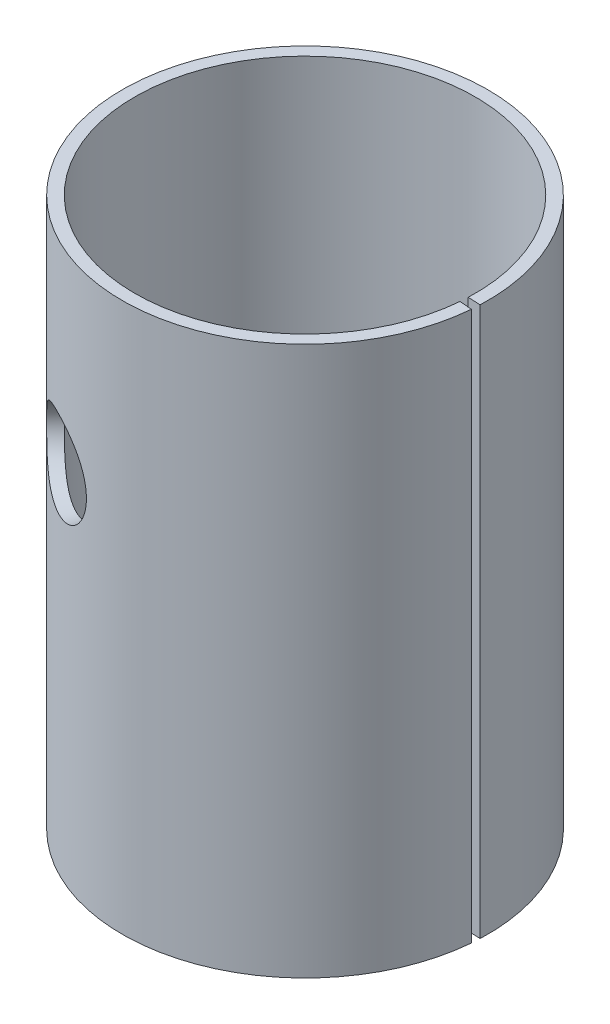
ISO-10303-21;
HEADER;
FILE_DESCRIPTION(('STEP AP214'),'2;1');
FILE_NAME('part.step','',(''),(''),'','','');
FILE_SCHEMA(('AUTOMOTIVE_DESIGN { 1 0 10303 214 1 1 1 1 }'));
ENDSEC;
DATA;
#1=APPLICATION_CONTEXT('core data for automotive mechanical design processes');
#2=APPLICATION_PROTOCOL_DEFINITION('international standard','automotive_design',2000,#1);
#3=PRODUCT_CONTEXT('',#1,'mechanical');
#4=PRODUCT('Part','Part','',(#3));
#5=PRODUCT_RELATED_PRODUCT_CATEGORY('part','',(#4));
#6=PRODUCT_DEFINITION_FORMATION('','',#4);
#7=PRODUCT_DEFINITION_CONTEXT('part definition',#1,'design');
#8=PRODUCT_DEFINITION('design','',#6,#7);
#9=PRODUCT_DEFINITION_SHAPE('','',#8);
#10=(LENGTH_UNIT() NAMED_UNIT(*) SI_UNIT(.MILLI.,.METRE.));
#11=(NAMED_UNIT(*) PLANE_ANGLE_UNIT() SI_UNIT($,.RADIAN.));
#12=(NAMED_UNIT(*) SI_UNIT($,.STERADIAN.) SOLID_ANGLE_UNIT());
#13=UNCERTAINTY_MEASURE_WITH_UNIT(LENGTH_MEASURE(1.E-05),#10,'distance_accuracy_value','');
#14=(GEOMETRIC_REPRESENTATION_CONTEXT(3) GLOBAL_UNCERTAINTY_ASSIGNED_CONTEXT((#13)) GLOBAL_UNIT_ASSIGNED_CONTEXT((#10,
#11,#12)) REPRESENTATION_CONTEXT('',''));
#15=CARTESIAN_POINT('',(0.,0.,0.));
#16=DIRECTION('',(0.,0.,1.));
#17=DIRECTION('',(1.,0.,0.));
#18=AXIS2_PLACEMENT_3D('',#15,#16,#17);
#19=CARTESIAN_POINT('',(311.993438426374,-97.,-312.641896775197));
#20=DIRECTION('',(-0.0858586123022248,0.,0.996307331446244));
#21=DIRECTION('',(0.,-1.,0.));
#22=AXIS2_PLACEMENT_3D('',#19,#20,#21);
#23=PLANE('',#22);
#24=DIRECTION('',(0.996307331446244,0.,0.0858586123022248));
#25=VECTOR('',#24,1.);
#26=CARTESIAN_POINT('',(311.993438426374,-427.,-312.641896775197));
#27=LINE('',#26,#25);
#28=CARTESIAN_POINT('',(304.521133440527,-427.,-313.285836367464));
#29=VERTEX_POINT('',#28);
#30=CARTESIAN_POINT('',(319.46574341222,-427.,-311.997957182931));
#31=VERTEX_POINT('',#30);
#32=EDGE_CURVE('E14',#29,#31,#27,.T.);
#33=ORIENTED_EDGE('',*,*,#32,.F.);
#34=DIRECTION('',(0.,-1.,0.));
#35=VECTOR('',#34,1.);
#36=CARTESIAN_POINT('',(304.521133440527,1713.30665560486,-313.285836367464));
#37=LINE('',#36,#35);
#38=CARTESIAN_POINT('',(304.521133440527,233.,-313.285836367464));
#39=VERTEX_POINT('',#38);
#40=EDGE_CURVE('E93',#39,#29,#37,.T.);
#41=ORIENTED_EDGE('',*,*,#40,.F.);
#42=DIRECTION('',(0.996307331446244,0.,0.0858586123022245));
#43=VECTOR('',#42,1.);
#44=CARTESIAN_POINT('',(311.993438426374,233.,-312.641896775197));
#45=LINE('',#44,#43);
#46=CARTESIAN_POINT('',(319.46574341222,233.,-311.997957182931));
#47=VERTEX_POINT('',#46);
#48=EDGE_CURVE('E68',#39,#47,#45,.T.);
#49=ORIENTED_EDGE('',*,*,#48,.T.);
#50=DIRECTION('',(0.,-1.,0.));
#51=VECTOR('',#50,1.);
#52=CARTESIAN_POINT('',(319.46574341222,1713.30665560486,-311.997957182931));
#53=LINE('',#52,#51);
#54=EDGE_CURVE('E95',#47,#31,#53,.T.);
#55=ORIENTED_EDGE('',*,*,#54,.T.);
#56=EDGE_LOOP('',(#33,#41,#49,#55));
#57=FACE_BOUND('',#56,.T.);
#58=ADVANCED_FACE('F58',(#57),#23,.F.);
#59=CARTESIAN_POINT('',(100.573445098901,233.,-330.861402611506));
#60=DIRECTION('',(0.,-1.,0.));
#61=DIRECTION('',(0.,0.,-1.));
#62=AXIS2_PLACEMENT_3D('',#59,#60,#61);
#63=PLANE('',#62);
#64=ORIENTED_EDGE('',*,*,#48,.F.);
#65=CARTESIAN_POINT('',(100.573445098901,233.,-330.861402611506));
#66=DIRECTION('',(0.,-1.,0.));
#67=DIRECTION('',(0.,0.,-1.));
#68=AXIS2_PLACEMENT_3D('',#65,#66,#67);
#69=CIRCLE('',#68,204.703590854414);
#70=CARTESIAN_POINT('',(305.106893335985,233.,-322.517023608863));
#71=VERTEX_POINT('',#70);
#72=EDGE_CURVE('E104',#71,#39,#69,.F.);
#73=ORIENTED_EDGE('',*,*,#72,.F.);
#74=DIRECTION('',(0.999168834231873,0.,0.0407632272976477));
#75=VECTOR('',#74,1.);
#76=CARTESIAN_POINT('',(312.600659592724,233.,-322.211299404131));
#77=LINE('',#76,#75);
#78=CARTESIAN_POINT('',(320.094425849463,233.,-321.905575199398));
#79=VERTEX_POINT('',#78);
#80=EDGE_CURVE('E161',#71,#79,#77,.T.);
#81=ORIENTED_EDGE('',*,*,#80,.T.);
#82=CARTESIAN_POINT('',(100.573445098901,233.,-330.861402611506));
#83=DIRECTION('',(0.,-1.,0.));
#84=DIRECTION('',(0.,0.,-1.));
#85=AXIS2_PLACEMENT_3D('',#82,#83,#84);
#86=CIRCLE('',#85,219.703590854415);
#87=EDGE_CURVE('E163',#79,#47,#86,.F.);
#88=ORIENTED_EDGE('',*,*,#87,.T.);
#89=EDGE_LOOP('',(#64,#73,#81,#88));
#90=FACE_BOUND('',#89,.T.);
#91=ADVANCED_FACE('F159',(#90),#63,.F.);
#92=CARTESIAN_POINT('',(312.600659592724,-97.,-322.211299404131));
#93=DIRECTION('',(0.0407632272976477,0.,-0.999168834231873));
#94=DIRECTION('',(0.,1.,0.));
#95=AXIS2_PLACEMENT_3D('',#92,#93,#94);
#96=PLANE('',#95);
#97=ORIENTED_EDGE('',*,*,#80,.F.);
#98=DIRECTION('',(0.,-1.,0.));
#99=VECTOR('',#98,1.);
#100=CARTESIAN_POINT('',(305.106893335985,1713.30665560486,-322.517023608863));
#101=LINE('',#100,#99);
#102=CARTESIAN_POINT('',(305.106893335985,-427.,-322.517023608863));
#103=VERTEX_POINT('',#102);
#104=EDGE_CURVE('E150',#103,#71,#101,.F.);
#105=ORIENTED_EDGE('',*,*,#104,.F.);
#106=DIRECTION('',(0.999168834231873,0.,0.0407632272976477));
#107=VECTOR('',#106,1.);
#108=CARTESIAN_POINT('',(312.600659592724,-427.,-322.211299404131));
#109=LINE('',#108,#107);
#110=CARTESIAN_POINT('',(320.094425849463,-427.,-321.905575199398));
#111=VERTEX_POINT('',#110);
#112=EDGE_CURVE('E62',#103,#111,#109,.T.);
#113=ORIENTED_EDGE('',*,*,#112,.T.);
#114=DIRECTION('',(0.,-1.,0.));
#115=VECTOR('',#114,1.);
#116=CARTESIAN_POINT('',(320.094425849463,1713.30665560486,-321.905575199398));
#117=LINE('',#116,#115);
#118=EDGE_CURVE('E111',#111,#79,#117,.F.);
#119=ORIENTED_EDGE('',*,*,#118,.T.);
#120=EDGE_LOOP('',(#97,#105,#113,#119));
#121=FACE_BOUND('',#120,.T.);
#122=ADVANCED_FACE('F135',(#121),#96,.F.);
#123=CARTESIAN_POINT('',(100.573445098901,-427.,-330.861402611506));
#124=DIRECTION('',(0.,-1.,0.));
#125=DIRECTION('',(0.,0.,-1.));
#126=AXIS2_PLACEMENT_3D('',#123,#124,#125);
#127=PLANE('',#126);
#128=CARTESIAN_POINT('',(100.573445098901,-427.,-330.861402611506));
#129=DIRECTION('',(0.,-1.,0.));
#130=DIRECTION('',(0.,0.,-1.));
#131=AXIS2_PLACEMENT_3D('',#128,#129,#130);
#132=CIRCLE('',#131,204.703590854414);
#133=EDGE_CURVE('E102',#103,#29,#132,.F.);
#134=ORIENTED_EDGE('',*,*,#133,.T.);
#135=ORIENTED_EDGE('',*,*,#32,.T.);
#136=CARTESIAN_POINT('',(100.573445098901,-427.,-330.861402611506));
#137=DIRECTION('',(0.,-1.,0.));
#138=DIRECTION('',(0.,0.,-1.));
#139=AXIS2_PLACEMENT_3D('',#136,#137,#138);
#140=CIRCLE('',#139,219.703590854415);
#141=EDGE_CURVE('E148',#111,#31,#140,.F.);
#142=ORIENTED_EDGE('',*,*,#141,.F.);
#143=ORIENTED_EDGE('',*,*,#112,.F.);
#144=EDGE_LOOP('',(#134,#135,#142,#143));
#145=FACE_BOUND('',#144,.T.);
#146=ADVANCED_FACE('F60',(#145),#127,.T.);
#147=CARTESIAN_POINT('',(52.0000000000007,-1.77635683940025E-12,-116.594540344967));
#148=CARTESIAN_POINT('',(51.9998550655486,7.17889015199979,-116.594573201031));
#149=CARTESIAN_POINT('',(50.4963681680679,14.3442404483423,-116.920212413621));
#150=CARTESIAN_POINT('',(46.1586479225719,24.2136141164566,-117.997790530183));
#151=CARTESIAN_POINT('',(44.3730741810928,27.3473717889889,-118.456435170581));
#152=CARTESIAN_POINT('',(40.1996482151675,33.179107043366,-119.604789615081));
#153=CARTESIAN_POINT('',(37.8083589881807,35.8772505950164,-120.296105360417));
#154=CARTESIAN_POINT('',(32.5679601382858,40.6940895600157,-121.92970454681));
#155=CARTESIAN_POINT('',(29.6892482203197,42.8348476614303,-122.882274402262));
#156=CARTESIAN_POINT('',(25.1734606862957,45.5344107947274,-124.495065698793));
#157=CARTESIAN_POINT('',(23.6127700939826,46.3619931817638,-125.071286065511));
#158=CARTESIAN_POINT('',(21.247911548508,47.4683329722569,-125.976459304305));
#159=CARTESIAN_POINT('',(20.4520874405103,47.8166652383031,-126.286276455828));
#160=CARTESIAN_POINT('',(18.8457237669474,48.4724344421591,-126.922701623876));
#161=CARTESIAN_POINT('',(18.0247782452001,48.7835235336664,-127.253576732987));
#162=CARTESIAN_POINT('',(15.6028758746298,49.6335348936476,-128.246705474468));
#163=CARTESIAN_POINT('',(13.9676083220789,50.118470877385,-128.939731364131));
#164=CARTESIAN_POINT('',(11.4857439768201,50.7232674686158,-130.0284734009));
#165=CARTESIAN_POINT('',(10.6536306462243,50.9044317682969,-130.399588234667));
#166=CARTESIAN_POINT('',(9.39849532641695,51.1455263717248,-130.968912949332));
#167=CARTESIAN_POINT('',(8.97895612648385,51.2207825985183,-131.160796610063));
#168=CARTESIAN_POINT('',(8.13760316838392,51.3610777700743,-131.548840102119));
#169=CARTESIAN_POINT('',(7.7050914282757,51.4276326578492,-131.750016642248));
#170=CARTESIAN_POINT('',(5.64394616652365,51.7197044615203,-132.716569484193));
#171=CARTESIAN_POINT('',(3.9901759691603,51.8737297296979,-133.517098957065));
#172=CARTESIAN_POINT('',(1.50380619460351,51.9853193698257,-134.760069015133));
#173=CARTESIAN_POINT('',(0.674064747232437,52.0026078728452,-135.181421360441));
#174=CARTESIAN_POINT('',(-0.571770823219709,51.9986785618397,-135.824145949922));
#175=CARTESIAN_POINT('',(-0.987253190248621,51.992391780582,-136.040170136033));
#176=CARTESIAN_POINT('',(-1.81859095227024,51.9698641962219,-136.47580897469));
#177=CARTESIAN_POINT('',(-2.24503789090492,51.9530832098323,-136.701060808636));
#178=CARTESIAN_POINT('',(-4.27220193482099,51.8496950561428,-137.779986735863));
#179=CARTESIAN_POINT('',(-5.8840940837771,51.6918443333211,-138.663995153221));
#180=CARTESIAN_POINT('',(-8.28635132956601,51.3423579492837,-140.021002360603));
#181=CARTESIAN_POINT('',(-9.08450696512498,51.2070774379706,-140.478503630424));
#182=CARTESIAN_POINT('',(-10.2777429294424,50.9759790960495,-141.172463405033));
#183=CARTESIAN_POINT('',(-10.6748220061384,50.8942500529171,-141.405067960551));
#184=CARTESIAN_POINT('',(-11.4676306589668,50.7213994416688,-141.872839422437));
#185=CARTESIAN_POINT('',(-11.8710261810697,50.6284185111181,-142.112594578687));
#186=CARTESIAN_POINT('',(-13.8079281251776,50.1586261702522,-143.271876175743));
#187=CARTESIAN_POINT('',(-15.3337808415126,49.7136602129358,-144.211083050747));
#188=CARTESIAN_POINT('',(-18.3383317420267,48.6854641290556,-146.110716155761));
#189=CARTESIAN_POINT('',(-19.8272907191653,48.0976343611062,-147.077980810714));
#190=CARTESIAN_POINT('',(-22.7172760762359,46.8021092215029,-149.004092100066));
#191=CARTESIAN_POINT('',(-24.1250990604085,46.0924288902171,-149.967109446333));
#192=CARTESIAN_POINT('',(-26.1823358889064,44.9350317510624,-151.408509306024));
#193=CARTESIAN_POINT('',(-26.8589992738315,44.5337532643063,-151.888456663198));
#194=CARTESIAN_POINT('',(-28.1943788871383,43.7002374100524,-152.846822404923));
#195=CARTESIAN_POINT('',(-28.8460131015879,43.2728792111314,-153.320037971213));
#196=CARTESIAN_POINT('',(-30.8168198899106,41.9150912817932,-154.767893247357));
#197=CARTESIAN_POINT('',(-32.0799766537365,40.9565076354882,-155.718370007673));
#198=CARTESIAN_POINT('',(-33.9010924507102,39.4385446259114,-157.117761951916));
#199=CARTESIAN_POINT('',(-34.4958611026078,38.9192090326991,-157.579842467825));
#200=CARTESIAN_POINT('',(-35.3699139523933,38.1201837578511,-158.26589819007));
#201=CARTESIAN_POINT('',(-35.6582481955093,37.8505050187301,-158.493406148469));
#202=CARTESIAN_POINT('',(-36.2289337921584,37.3044735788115,-158.945988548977));
#203=CARTESIAN_POINT('',(-36.5022630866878,37.0371527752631,-159.163835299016));
#204=CARTESIAN_POINT('',(-37.9442986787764,35.5935448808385,-160.319069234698));
#205=CARTESIAN_POINT('',(-39.033639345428,34.3953504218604,-161.210825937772));
#206=CARTESIAN_POINT('',(-40.5747713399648,32.5330965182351,-162.494850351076));
#207=CARTESIAN_POINT('',(-41.0730001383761,31.9015181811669,-162.913929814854));
#208=CARTESIAN_POINT('',(-41.7975443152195,30.9379101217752,-163.528591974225));
#209=CARTESIAN_POINT('',(-42.0352590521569,30.6140006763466,-163.731153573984));
#210=CARTESIAN_POINT('',(-42.3861827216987,30.1240763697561,-164.031440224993));
#211=CARTESIAN_POINT('',(-42.5022158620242,29.960091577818,-164.130943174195));
#212=CARTESIAN_POINT('',(-42.7324077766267,29.6307686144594,-164.328752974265));
#213=CARTESIAN_POINT('',(-42.8406420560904,29.4741171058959,-164.421947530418));
#214=CARTESIAN_POINT('',(-43.9129945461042,27.9018033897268,-165.347289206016));
#215=CARTESIAN_POINT('',(-44.7887933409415,26.4728626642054,-166.117239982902));
#216=CARTESIAN_POINT('',(-45.9906100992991,24.2824587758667,-167.188150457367));
#217=CARTESIAN_POINT('',(-46.3725632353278,23.5444920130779,-167.531127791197));
#218=CARTESIAN_POINT('',(-46.9179896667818,22.4257936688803,-168.024046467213));
#219=CARTESIAN_POINT('',(-47.0952142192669,22.0509361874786,-168.184762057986));
#220=CARTESIAN_POINT('',(-47.3542305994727,21.4857129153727,-168.42038494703));
#221=CARTESIAN_POINT('',(-47.4394326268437,21.2968156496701,-168.498017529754));
#222=CARTESIAN_POINT('',(-47.6075721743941,20.9180421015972,-168.651455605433));
#223=CARTESIAN_POINT('',(-47.6870928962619,20.7361164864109,-168.724133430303));
#224=CARTESIAN_POINT('',(-48.1132252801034,19.7445341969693,-169.114206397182));
#225=CARTESIAN_POINT('',(-48.4333182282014,18.9454174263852,-169.409183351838));
#226=CARTESIAN_POINT('',(-48.8827168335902,17.7379658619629,-169.825489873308));
#227=CARTESIAN_POINT('',(-49.0273923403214,17.334019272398,-169.959899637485));
#228=CARTESIAN_POINT('',(-49.3065682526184,16.5232006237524,-170.219920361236));
#229=CARTESIAN_POINT('',(-49.4373004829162,16.1282151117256,-170.342003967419));
#230=CARTESIAN_POINT('',(-49.8369460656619,14.8675510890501,-170.71610842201));
#231=CARTESIAN_POINT('',(-50.0809390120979,14.0240928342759,-170.945745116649));
#232=CARTESIAN_POINT('',(-50.4136899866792,12.7543820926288,-171.260098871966));
#233=CARTESIAN_POINT('',(-50.51906649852,12.3303912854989,-171.359867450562));
#234=CARTESIAN_POINT('',(-50.7187992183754,11.4809018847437,-171.549307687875));
#235=CARTESIAN_POINT('',(-50.8114030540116,11.0638079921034,-171.637311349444));
#236=CARTESIAN_POINT('',(-51.0832802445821,9.75983642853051,-171.896097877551));
#237=CARTESIAN_POINT('',(-51.2420265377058,8.8864334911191,-172.047782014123));
#238=CARTESIAN_POINT('',(-51.5148883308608,7.1314504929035,-172.309069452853));
#239=CARTESIAN_POINT('',(-51.6278516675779,6.26097011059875,-172.417564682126));
#240=CARTESIAN_POINT('',(-51.9071210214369,3.57066520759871,-172.686146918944));
#241=CARTESIAN_POINT('',(-51.9999825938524,1.78176745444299,-172.775928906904));
#242=CARTESIAN_POINT('',(-52.0000088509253,-0.890864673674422,-172.775954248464));
#243=CARTESIAN_POINT('',(-51.9767774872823,-1.783318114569,-172.753522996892));
#244=CARTESIAN_POINT('',(-51.8837751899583,-3.57137712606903,-172.663842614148));
#245=CARTESIAN_POINT('',(-51.8127725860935,-4.47884804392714,-172.595408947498));
#246=CARTESIAN_POINT('',(-51.6289765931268,-6.24948062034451,-172.418646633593));
#247=CARTESIAN_POINT('',(-51.5148836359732,-7.13088607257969,-172.309064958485));
#248=CARTESIAN_POINT('',(-51.3102455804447,-8.44712799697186,-172.1131073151));
#249=CARTESIAN_POINT('',(-51.2364489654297,-8.88489759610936,-172.042524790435));
#250=CARTESIAN_POINT('',(-51.0776436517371,-9.75848137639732,-171.890879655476));
#251=CARTESIAN_POINT('',(-50.9908282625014,-10.2029629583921,-171.808097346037));
#252=CARTESIAN_POINT('',(-50.7243279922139,-11.4814701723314,-171.554428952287));
#253=CARTESIAN_POINT('',(-50.5246995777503,-12.330879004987,-171.364971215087));
#254=CARTESIAN_POINT('',(-50.1919683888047,-13.6005982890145,-171.050635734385));
#255=CARTESIAN_POINT('',(-50.0755091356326,-14.0231057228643,-170.940833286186));
#256=CARTESIAN_POINT('',(-49.8314261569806,-14.8666559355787,-170.711252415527));
#257=CARTESIAN_POINT('',(-49.6999645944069,-15.2998050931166,-170.587881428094));
#258=CARTESIAN_POINT('',(-49.311751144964,-16.524417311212,-170.224478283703));
#259=CARTESIAN_POINT('',(-49.0326844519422,-17.3351023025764,-169.964414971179));
#260=CARTESIAN_POINT('',(-48.583273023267,-18.542545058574,-169.548095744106));
#261=CARTESIAN_POINT('',(-48.4283333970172,-18.9435951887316,-169.404952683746));
#262=CARTESIAN_POINT('',(-48.1881619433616,-19.5430242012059,-169.183748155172));
#263=CARTESIAN_POINT('',(-48.1068110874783,-19.7424761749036,-169.108931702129));
#264=CARTESIAN_POINT('',(-47.9415118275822,-20.1406647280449,-168.957146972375));
#265=CARTESIAN_POINT('',(-47.8541197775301,-20.3474145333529,-168.877026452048));
#266=CARTESIAN_POINT('',(-47.117841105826,-22.0607054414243,-168.203051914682));
#267=CARTESIAN_POINT('',(-46.3912196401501,-23.5523039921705,-167.545124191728));
#268=CARTESIAN_POINT('',(-45.1894058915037,-25.7427117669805,-166.474216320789));
#269=CARTESIAN_POINT('',(-44.7701480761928,-26.4650160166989,-166.103253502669));
#270=CARTESIAN_POINT('',(-44.1127704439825,-27.5367248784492,-165.526433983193));
#271=CARTESIAN_POINT('',(-43.8888957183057,-27.8920032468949,-165.330765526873));
#272=CARTESIAN_POINT('',(-43.5458932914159,-28.4219839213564,-165.032252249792));
#273=CARTESIAN_POINT('',(-43.4303607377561,-28.5981546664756,-164.931912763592));
#274=CARTESIAN_POINT('',(-43.1968873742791,-28.9495171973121,-164.729577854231));
#275=CARTESIAN_POINT('',(-43.0730221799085,-29.1333954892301,-164.622470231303));
#276=CARTESIAN_POINT('',(-42.0539849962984,-30.6275376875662,-163.743134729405));
#277=CARTESIAN_POINT('',(-41.0884789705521,-31.9123521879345,-162.922855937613));
#278=CARTESIAN_POINT('',(-39.547348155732,-33.7746060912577,-161.638832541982));
#279=CARTESIAN_POINT('',(-39.0181566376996,-34.3845294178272,-161.201896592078));
#280=CARTESIAN_POINT('',(-38.2007097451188,-35.2831724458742,-160.533701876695));
#281=CARTESIAN_POINT('',(-37.92428403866,-35.5800131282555,-160.308838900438));
#282=CARTESIAN_POINT('',(-37.3634712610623,-36.1682805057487,-159.854955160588));
#283=CARTESIAN_POINT('',(-37.0700645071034,-36.4687367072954,-159.618708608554));
#284=CARTESIAN_POINT('',(-35.6731353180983,-37.8671876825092,-158.499609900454));
#285=CARTESIAN_POINT('',(-34.5081345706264,-38.9325560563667,-157.584228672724));
#286=CARTESIAN_POINT('',(-32.6870180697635,-40.450520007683,-156.184836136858));
#287=CARTESIAN_POINT('',(-32.0677095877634,-40.9431598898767,-155.713988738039));
#288=CARTESIAN_POINT('',(-30.8041450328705,-41.9017434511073,-154.764209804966));
#289=CARTESIAN_POINT('',(-30.15279753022,-42.3725727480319,-154.280068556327));
#290=CARTESIAN_POINT('',(-28.2032683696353,-43.7157026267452,-152.847844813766));
#291=CARTESIAN_POINT('',(-26.868119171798,-44.549211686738,-151.889002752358));
#292=CARTESIAN_POINT('',(-24.1251371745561,-46.0924080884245,-149.967135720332));
#293=CARTESIAN_POINT('',(-22.7274993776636,-46.7975248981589,-149.010905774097));
#294=CARTESIAN_POINT('',(-19.8170795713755,-48.1022189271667,-147.071175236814));
#295=CARTESIAN_POINT('',(-18.3384035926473,-48.6854415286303,-146.110762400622));
#296=CARTESIAN_POINT('',(-16.0849908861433,-49.4565888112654,-144.686036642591));
#297=CARTESIAN_POINT('',(-15.3279541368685,-49.6963568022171,-144.213777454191));
#298=CARTESIAN_POINT('',(-14.1835309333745,-50.0300871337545,-143.509581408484));
#299=CARTESIAN_POINT('',(-13.8005785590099,-50.1370103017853,-143.275548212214));
#300=CARTESIAN_POINT('',(-13.0317151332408,-50.3422160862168,-142.808916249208));
#301=CARTESIAN_POINT('',(-12.6534319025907,-50.4386485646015,-142.580882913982));
#302=CARTESIAN_POINT('',(-10.6783348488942,-50.9177109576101,-141.398740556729));
#303=CARTESIAN_POINT('',(-9.08727315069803,-51.2258314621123,-140.473435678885));
#304=CARTESIAN_POINT('',(-6.68501809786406,-51.5753181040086,-139.116426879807));
#305=CARTESIAN_POINT('',(-5.88165605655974,-51.6730312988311,-138.669248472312));
#306=CARTESIAN_POINT('',(-4.67279967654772,-51.7914275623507,-138.006257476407));
#307=CARTESIAN_POINT('',(-4.26921200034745,-51.826197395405,-137.786556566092));
#308=CARTESIAN_POINT('',(-3.46078262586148,-51.8863458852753,-137.349753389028));
#309=CARTESIAN_POINT('',(-3.06647379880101,-51.9111872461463,-137.13825707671));
#310=CARTESIAN_POINT('',(-0.98650865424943,-52.0172890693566,-136.031228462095));
#311=CARTESIAN_POINT('',(0.674816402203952,-52.0225332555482,-135.174494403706));
#312=CARTESIAN_POINT('',(3.16118445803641,-51.9109436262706,-133.931522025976));
#313=CARTESIAN_POINT('',(3.98903812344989,-51.8538377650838,-133.524218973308));
#314=CARTESIAN_POINT('',(5.22921703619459,-51.7383149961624,-132.923642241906));
#315=CARTESIAN_POINT('',(5.64234313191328,-51.6948300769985,-132.725179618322));
#316=CARTESIAN_POINT('',(6.46802922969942,-51.5979055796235,-132.331687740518));
#317=CARTESIAN_POINT('',(6.86994984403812,-51.5459735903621,-132.141647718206));
#318=CARTESIAN_POINT('',(8.98445180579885,-51.24635110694,-131.150073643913));
#319=CARTESIAN_POINT('',(10.6582832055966,-50.9249033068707,-130.391464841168));
#320=CARTESIAN_POINT('',(13.1401484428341,-50.3201068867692,-129.302719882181));
#321=CARTESIAN_POINT('',(13.9626252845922,-50.0980706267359,-128.947999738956));
#322=CARTESIAN_POINT('',(15.5976090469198,-49.6131232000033,-128.254483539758));
#323=CARTESIAN_POINT('',(16.3998415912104,-49.3538179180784,-127.919900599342));
#324=CARTESIAN_POINT('',(20.4879957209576,-47.9190453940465,-126.243506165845));
#325=CARTESIAN_POINT('',(23.6513518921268,-46.4443304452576,-125.038679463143));
#326=CARTESIAN_POINT('',(29.7060825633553,-42.824780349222,-122.876262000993));
#327=CARTESIAN_POINT('',(32.563744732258,-40.6979481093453,-121.931018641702));
#328=CARTESIAN_POINT('',(40.4369851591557,-33.4611119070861,-119.476678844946));
#329=CARTESIAN_POINT('',(44.7181309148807,-27.4909932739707,-118.355644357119));
#330=CARTESIAN_POINT('',(50.490972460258,-14.3566651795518,-116.921552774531));
#331=CARTESIAN_POINT('',(52.0001449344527,-7.17889015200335,-116.594507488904));
#332=CARTESIAN_POINT('',(52.0000000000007,-1.77635683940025E-12,-116.594540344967));
#333=CARTESIAN_POINT('',(55.3162938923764,-1.77635683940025E-12,-131.223354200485));
#334=CARTESIAN_POINT('',(55.3161588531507,7.17889015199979,-131.22338481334));
#335=CARTESIAN_POINT('',(53.915320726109,14.3442404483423,-131.526791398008));
#336=CARTESIAN_POINT('',(49.8737531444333,24.2136141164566,-132.530799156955));
#337=CARTESIAN_POINT('',(48.2100873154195,27.3473717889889,-132.95813038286));
#338=CARTESIAN_POINT('',(44.3215970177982,33.179107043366,-134.028082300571));
#339=CARTESIAN_POINT('',(42.0935702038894,35.8772505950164,-134.672199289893));
#340=CARTESIAN_POINT('',(37.2109533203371,40.6940895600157,-136.194266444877));
#341=CARTESIAN_POINT('',(34.5287820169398,42.8348476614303,-137.081800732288));
#342=CARTESIAN_POINT('',(30.3213044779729,45.5344107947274,-138.584480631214));
#343=CARTESIAN_POINT('',(28.8671681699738,46.3619931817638,-139.121360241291));
#344=CARTESIAN_POINT('',(26.663767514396,47.4683329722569,-139.964733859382));
#345=CARTESIAN_POINT('',(25.9222773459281,47.8166652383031,-140.253398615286));
#346=CARTESIAN_POINT('',(24.4255862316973,48.4724344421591,-140.846372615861));
#347=CARTESIAN_POINT('',(23.6606897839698,48.7835235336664,-141.154657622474));
#348=CARTESIAN_POINT('',(21.4041399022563,49.6335348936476,-142.07998168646));
#349=CARTESIAN_POINT('',(19.8805182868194,50.118470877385,-142.72569206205));
#350=CARTESIAN_POINT('',(17.568100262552,50.7232674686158,-143.740101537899));
#351=CARTESIAN_POINT('',(16.7927984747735,50.9044317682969,-144.085878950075));
#352=CARTESIAN_POINT('',(15.6233560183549,51.1455263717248,-144.6163337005));
#353=CARTESIAN_POINT('',(15.2324603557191,51.2207825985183,-144.7951167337));
#354=CARTESIAN_POINT('',(14.448549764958,51.3610777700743,-145.15666702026));
#355=CARTESIAN_POINT('',(14.0455672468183,51.4276326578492,-145.344108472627));
#356=CARTESIAN_POINT('',(12.1251442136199,51.7197044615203,-146.244671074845));
#357=CARTESIAN_POINT('',(10.5842831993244,51.8737297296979,-146.990545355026));
#358=CARTESIAN_POINT('',(8.26766734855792,51.9853193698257,-148.148653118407));
#359=CARTESIAN_POINT('',(7.49457550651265,52.0026078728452,-148.541238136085));
#360=CARTESIAN_POINT('',(6.33379787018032,51.9986785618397,-149.140081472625));
#361=CARTESIAN_POINT('',(5.94668206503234,51.992391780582,-149.341356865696));
#362=CARTESIAN_POINT('',(5.17210289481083,51.9698641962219,-149.74725298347));
#363=CARTESIAN_POINT('',(4.77477111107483,51.9530832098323,-149.957126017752));
#364=CARTESIAN_POINT('',(2.88600926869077,51.8496950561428,-150.962389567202));
#365=CARTESIAN_POINT('',(1.38416712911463,51.6918443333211,-151.786043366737));
#366=CARTESIAN_POINT('',(-0.854078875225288,51.3423579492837,-153.050402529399));
#367=CARTESIAN_POINT('',(-1.59774138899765,51.2070774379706,-153.476668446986));
#368=CARTESIAN_POINT('',(-2.70951059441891,50.9759790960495,-154.123248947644));
#369=CARTESIAN_POINT('',(-3.0794795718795,50.8942500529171,-154.339972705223));
#370=CARTESIAN_POINT('',(-3.81816016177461,50.7213994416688,-154.775807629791));
#371=CARTESIAN_POINT('',(-4.19401433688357,50.6284185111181,-154.999193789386));
#372=CARTESIAN_POINT('',(-5.99867661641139,50.1586261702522,-156.079326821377));
#373=CARTESIAN_POINT('',(-7.42035356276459,49.7136602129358,-156.954410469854));
#374=CARTESIAN_POINT('',(-10.2197723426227,48.6854641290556,-158.724348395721));
#375=CARTESIAN_POINT('',(-11.607074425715,48.0976343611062,-159.625574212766));
#376=CARTESIAN_POINT('',(-14.2997494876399,46.8021092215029,-161.420182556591));
#377=CARTESIAN_POINT('',(-15.6114550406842,46.0924288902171,-162.317451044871));
#378=CARTESIAN_POINT('',(-17.5282364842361,44.9350317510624,-163.660441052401));
#379=CARTESIAN_POINT('',(-18.1587014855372,44.5337532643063,-164.107620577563));
#380=CARTESIAN_POINT('',(-19.4029096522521,43.7002374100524,-165.000555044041));
#381=CARTESIAN_POINT('',(-20.0100543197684,43.2728792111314,-165.441462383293));
#382=CARTESIAN_POINT('',(-21.8463066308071,41.9150912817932,-166.790467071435));
#383=CARTESIAN_POINT('',(-23.0232228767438,40.9565076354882,-167.676051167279));
#384=CARTESIAN_POINT('',(-24.7200041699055,39.4385446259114,-168.979901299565));
#385=CARTESIAN_POINT('',(-25.2741657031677,38.9192090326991,-169.410433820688));
#386=CARTESIAN_POINT('',(-26.0885436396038,38.1201837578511,-170.049649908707));
#387=CARTESIAN_POINT('',(-26.3571922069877,37.8505050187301,-170.261625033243));
#388=CARTESIAN_POINT('',(-26.888914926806,37.3044735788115,-170.683307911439));
#389=CARTESIAN_POINT('',(-27.1435829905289,37.0371527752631,-170.886281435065));
#390=CARTESIAN_POINT('',(-28.4871653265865,35.5935448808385,-171.962643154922));
#391=CARTESIAN_POINT('',(-29.5021325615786,34.3953504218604,-172.79351623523));
#392=CARTESIAN_POINT('',(-30.9380456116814,32.5330965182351,-173.989875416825));
#393=CARTESIAN_POINT('',(-31.4022584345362,31.9015181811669,-174.380342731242));
#394=CARTESIAN_POINT('',(-32.077335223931,30.9379101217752,-174.953039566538));
#395=CARTESIAN_POINT('',(-32.2988202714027,30.6140006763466,-175.141771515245));
#396=CARTESIAN_POINT('',(-32.6257850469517,30.1240763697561,-175.421556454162));
#397=CARTESIAN_POINT('',(-32.7338961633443,29.960091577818,-175.514265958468));
#398=CARTESIAN_POINT('',(-32.9483720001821,29.6307686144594,-175.698570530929));
#399=CARTESIAN_POINT('',(-33.0492167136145,29.4741171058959,-175.785402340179));
#400=CARTESIAN_POINT('',(-34.0483556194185,27.9018033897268,-176.647567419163));
#401=CARTESIAN_POINT('',(-34.8643602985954,26.4728626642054,-177.364950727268));
#402=CARTESIAN_POINT('',(-35.9841244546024,24.2824587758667,-178.362746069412));
#403=CARTESIAN_POINT('',(-36.340000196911,23.5444920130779,-178.682307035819));
#404=CARTESIAN_POINT('',(-36.8481882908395,22.4257936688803,-179.141572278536));
#405=CARTESIAN_POINT('',(-37.0133130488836,22.0509361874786,-179.291315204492));
#406=CARTESIAN_POINT('',(-37.2546453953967,21.4857129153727,-179.510851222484));
#407=CARTESIAN_POINT('',(-37.3340303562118,21.2968156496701,-179.583183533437));
#408=CARTESIAN_POINT('',(-37.4906903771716,20.9180421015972,-179.726145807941));
#409=CARTESIAN_POINT('',(-37.5647819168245,20.7361164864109,-179.793861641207));
#410=CARTESIAN_POINT('',(-37.9618206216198,19.7445341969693,-180.157302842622));
#411=CARTESIAN_POINT('',(-38.260059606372,18.9454174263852,-180.432140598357));
#412=CARTESIAN_POINT('',(-38.6787760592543,17.7379658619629,-180.820024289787));
#413=CARTESIAN_POINT('',(-38.8135740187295,17.334019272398,-180.945257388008));
#414=CARTESIAN_POINT('',(-39.0736895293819,16.5232006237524,-181.187525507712));
#415=CARTESIAN_POINT('',(-39.1954961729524,16.1282151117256,-181.301274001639));
#416=CARTESIAN_POINT('',(-39.5678564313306,14.8675510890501,-181.649836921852));
#417=CARTESIAN_POINT('',(-39.7951910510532,14.0240928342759,-181.863795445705));
#418=CARTESIAN_POINT('',(-40.1052238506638,12.7543820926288,-182.156687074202));
#419=CARTESIAN_POINT('',(-40.2034059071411,12.3303912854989,-182.249644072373));
#420=CARTESIAN_POINT('',(-40.3895021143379,11.4809018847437,-182.426150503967));
#421=CARTESIAN_POINT('',(-40.4757835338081,11.0638079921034,-182.508145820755));
#422=CARTESIAN_POINT('',(-40.7290986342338,9.75983642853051,-182.749264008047));
#423=CARTESIAN_POINT('',(-40.8770067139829,8.8864334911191,-182.890592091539));
#424=CARTESIAN_POINT('',(-41.1312391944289,7.1314504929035,-183.134040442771));
#425=CARTESIAN_POINT('',(-41.2364900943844,6.26097011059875,-183.235128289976));
#426=CARTESIAN_POINT('',(-41.4966926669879,3.57066520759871,-183.485373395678));
#427=CARTESIAN_POINT('',(-41.5832142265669,1.78176745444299,-183.569025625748));
#428=CARTESIAN_POINT('',(-41.5832386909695,-0.890864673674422,-183.569049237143));
#429=CARTESIAN_POINT('',(-41.5615934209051,-1.783318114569,-183.548149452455));
#430=CARTESIAN_POINT('',(-41.4749407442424,-3.57137712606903,-183.464591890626));
#431=CARTESIAN_POINT('',(-41.4087857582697,-4.47884804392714,-183.40083045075));
#432=CARTESIAN_POINT('',(-41.2375382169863,-6.24948062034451,-183.2361363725));
#433=CARTESIAN_POINT('',(-41.1312348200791,-7.13088607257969,-183.134036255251));
#434=CARTESIAN_POINT('',(-40.9405681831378,-8.44712799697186,-182.951457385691));
#435=CARTESIAN_POINT('',(-40.8718099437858,-8.88489759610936,-182.885693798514));
#436=CARTESIAN_POINT('',(-40.7238468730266,-9.75848137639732,-182.744402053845));
#437=CARTESIAN_POINT('',(-40.6429587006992,-10.2029629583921,-182.667271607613));
#438=CARTESIAN_POINT('',(-40.3946534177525,-11.4814701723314,-182.430922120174));
#439=CARTESIAN_POINT('',(-40.2086543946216,-12.330879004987,-182.254399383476));
#440=CARTESIAN_POINT('',(-39.8986400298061,-13.6005982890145,-181.961524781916));
#441=CARTESIAN_POINT('',(-39.7901318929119,-14.0231057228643,-181.859218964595));
#442=CARTESIAN_POINT('',(-39.5627133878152,-14.8666559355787,-181.645312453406));
#443=CARTESIAN_POINT('',(-39.4402272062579,-15.2998050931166,-181.530364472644));
#444=CARTESIAN_POINT('',(-39.078518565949,-16.524417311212,-181.191772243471));
#445=CARTESIAN_POINT('',(-38.8185048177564,-17.3351023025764,-180.949464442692));
#446=CARTESIAN_POINT('',(-38.3997764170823,-18.542545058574,-180.56156891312));
#447=CARTESIAN_POINT('',(-38.2554151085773,-18.9435951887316,-180.428198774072));
#448=CARTESIAN_POINT('',(-38.0316410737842,-19.5430242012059,-180.222096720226));
#449=CARTESIAN_POINT('',(-37.9558443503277,-19.7424761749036,-180.152388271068));
#450=CARTESIAN_POINT('',(-37.8018306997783,-20.1406647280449,-180.010966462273));
#451=CARTESIAN_POINT('',(-37.7204052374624,-20.3474145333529,-179.936316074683));
#452=CARTESIAN_POINT('',(-37.0343951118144,-22.0607054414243,-179.308356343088));
#453=CARTESIAN_POINT('',(-36.3573828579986,-23.5523039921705,-178.695347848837));
#454=CARTESIAN_POINT('',(-35.2376215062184,-25.7427117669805,-177.697554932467));
#455=CARTESIAN_POINT('',(-34.8469880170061,-26.4650160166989,-177.351919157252));
#456=CARTESIAN_POINT('',(-34.2344920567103,-27.5367248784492,-176.814481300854));
#457=CARTESIAN_POINT('',(-34.0259021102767,-27.8920032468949,-176.632171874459));
#458=CARTESIAN_POINT('',(-33.7063177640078,-28.4219839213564,-176.354039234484));
#459=CARTESIAN_POINT('',(-33.5986730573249,-28.5981546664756,-176.260550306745));
#460=CARTESIAN_POINT('',(-33.3811398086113,-28.9495171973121,-176.07202957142));
#461=CARTESIAN_POINT('',(-33.2657313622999,-29.1333954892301,-175.972234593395));
#462=CARTESIAN_POINT('',(-32.3162677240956,-30.6275376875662,-175.152934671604));
#463=CARTESIAN_POINT('',(-31.4166804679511,-31.9123521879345,-174.388659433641));
#464=CARTESIAN_POINT('',(-29.9807685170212,-33.7746060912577,-173.192301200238));
#465=CARTESIAN_POINT('',(-29.48770691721,-34.3845294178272,-172.785196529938));
#466=CARTESIAN_POINT('',(-28.7260702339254,-35.2831724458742,-172.16262200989));
#467=CARTESIAN_POINT('',(-28.4685171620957,-35.5800131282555,-171.953111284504));
#468=CARTESIAN_POINT('',(-27.9459932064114,-36.1682805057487,-171.530215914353));
#469=CARTESIAN_POINT('',(-27.672618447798,-36.4687367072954,-171.310098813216));
#470=CARTESIAN_POINT('',(-26.3710629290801,-37.8671876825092,-170.267405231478));
#471=CARTESIAN_POINT('',(-25.2856012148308,-38.9325560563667,-169.414520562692));
#472=CARTESIAN_POINT('',(-23.5888192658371,-40.450520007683,-168.110669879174));
#473=CARTESIAN_POINT('',(-23.0117933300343,-40.9431598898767,-167.67196902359));
#474=CARTESIAN_POINT('',(-21.834497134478,-41.9017434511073,-166.78703511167));
#475=CARTESIAN_POINT('',(-21.2276196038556,-42.3725727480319,-166.335948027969));
#476=CARTESIAN_POINT('',(-19.4111922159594,-43.7157026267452,-165.001507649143));
#477=CARTESIAN_POINT('',(-18.1671987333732,-44.549211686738,-164.108129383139));
#478=CARTESIAN_POINT('',(-15.6114905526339,-46.0924080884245,-162.317475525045));
#479=CARTESIAN_POINT('',(-14.309274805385,-46.7975248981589,-161.426531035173));
#480=CARTESIAN_POINT('',(-11.5975604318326,-48.1022189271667,-159.619233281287));
#481=CARTESIAN_POINT('',(-10.2198392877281,-48.6854415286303,-158.724391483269));
#482=CARTESIAN_POINT('',(-8.12027563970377,-49.4565888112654,-157.396937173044));
#483=CARTESIAN_POINT('',(-7.41492466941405,-49.6963568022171,-156.956920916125));
#484=CARTESIAN_POINT('',(-6.34863559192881,-50.0300871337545,-156.300803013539));
#485=CARTESIAN_POINT('',(-5.99182883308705,-50.1370103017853,-156.082748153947));
#486=CARTESIAN_POINT('',(-5.27545863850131,-50.3422160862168,-155.647974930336));
#487=CARTESIAN_POINT('',(-4.92300224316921,-50.4386485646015,-155.435510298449));
#488=CARTESIAN_POINT('',(-3.08275257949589,-50.9177109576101,-154.334077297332));
#489=CARTESIAN_POINT('',(-1.6003187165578,-51.2258314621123,-153.47194650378));
#490=CARTESIAN_POINT('',(0.637925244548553,-51.5753181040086,-152.207585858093));
#491=CARTESIAN_POINT('',(1.3864387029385,-51.6730312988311,-151.790938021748));
#492=CARTESIAN_POINT('',(2.51276185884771,-51.7914275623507,-151.173211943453));
#493=CARTESIAN_POINT('',(2.88879506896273,-51.826197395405,-150.968510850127));
#494=CARTESIAN_POINT('',(3.64202989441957,-51.8863458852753,-150.561529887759));
#495=CARTESIAN_POINT('',(4.00941775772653,-51.9111872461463,-150.364473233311));
#496=CARTESIAN_POINT('',(5.94737576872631,-52.0172890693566,-149.333025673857));
#497=CARTESIAN_POINT('',(7.49527584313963,-52.0225332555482,-148.534784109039));
#498=CARTESIAN_POINT('',(9.81189009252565,-51.9109436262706,-147.376674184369));
#499=CARTESIAN_POINT('',(10.5832230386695,-51.8538377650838,-146.997179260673));
#500=CARTESIAN_POINT('',(11.7387302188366,-51.7383149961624,-146.43760618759));
#501=CARTESIAN_POINT('',(12.123650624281,-51.6948300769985,-146.252693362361));
#502=CARTESIAN_POINT('',(12.8929639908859,-51.5979055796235,-145.886066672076));
#503=CARTESIAN_POINT('',(13.2674439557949,-51.5459735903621,-145.709001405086));
#504=CARTESIAN_POINT('',(15.2375808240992,-51.24635110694,-144.785125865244));
#505=CARTESIAN_POINT('',(16.797133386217,-50.9249033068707,-144.078310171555));
#506=CARTESIAN_POINT('',(19.1095522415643,-50.3201068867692,-143.063897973));
#507=CARTESIAN_POINT('',(19.8758754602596,-50.0980706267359,-142.733395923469));
#508=CARTESIAN_POINT('',(21.3992326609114,-49.6131232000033,-142.087228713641));
#509=CARTESIAN_POINT('',(22.1466937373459,-49.3538179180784,-141.775489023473));
#510=CARTESIAN_POINT('',(25.9557340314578,-47.9190453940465,-140.213548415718));
#511=CARTESIAN_POINT('',(28.903115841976,-46.4443304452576,-139.090979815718));
#512=CARTESIAN_POINT('',(34.5444670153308,-42.824780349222,-137.076198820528));
#513=CARTESIAN_POINT('',(37.2070257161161,-40.6979481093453,-136.195490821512));
#514=CARTESIAN_POINT('',(44.5427300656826,-33.4611119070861,-133.908718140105));
#515=CARTESIAN_POINT('',(48.531585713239,-27.4909932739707,-132.864220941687));
#516=CARTESIAN_POINT('',(53.9102934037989,-14.3566651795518,-131.528040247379));
#517=CARTESIAN_POINT('',(55.316428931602,-7.17889015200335,-131.22332358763));
#518=CARTESIAN_POINT('',(55.3162938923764,-1.77635683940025E-12,-131.223354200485));
#519=B_SPLINE_SURFACE_WITH_KNOTS('',1,3,((#147,#148,#149,#150,#151,#152,#153,#154,#155,#156,
#157,#158,#159,#160,#161,#162,#163,#164,#165,#166,#167,#168,#169,#170,#171,#172,#173,#174,#175,
#176,#177,#178,#179,#180,#181,#182,#183,#184,#185,#186,#187,#188,#189,#190,#191,#192,#193,#194,
#195,#196,#197,#198,#199,#200,#201,#202,#203,#204,#205,#206,#207,#208,#209,#210,#211,#212,#213,
#214,#215,#216,#217,#218,#219,#220,#221,#222,#223,#224,#225,#226,#227,#228,#229,#230,#231,#232,
#233,#234,#235,#236,#237,#238,#239,#240,#241,#242,#243,#244,#245,#246,#247,#248,#249,#250,#251,
#252,#253,#254,#255,#256,#257,#258,#259,#260,#261,#262,#263,#264,#265,#266,#267,#268,#269,#270,
#271,#272,#273,#274,#275,#276,#277,#278,#279,#280,#281,#282,#283,#284,#285,#286,#287,#288,#289,
#290,#291,#292,#293,#294,#295,#296,#297,#298,#299,#300,#301,#302,#303,#304,#305,#306,#307,#308,
#309,#310,#311,#312,#313,#314,#315,#316,#317,#318,#319,#320,#321,#322,#323,#324,#325,#326,#327,
#328,#329,#330,#331,#332),(#333,#334,#335,#336,#337,#338,#339,#340,#341,#342,#343,#344,#345,
#346,#347,#348,#349,#350,#351,#352,#353,#354,#355,#356,#357,#358,#359,#360,#361,#362,#363,#364,
#365,#366,#367,#368,#369,#370,#371,#372,#373,#374,#375,#376,#377,#378,#379,#380,#381,#382,#383,
#384,#385,#386,#387,#388,#389,#390,#391,#392,#393,#394,#395,#396,#397,#398,#399,#400,#401,#402,
#403,#404,#405,#406,#407,#408,#409,#410,#411,#412,#413,#414,#415,#416,#417,#418,#419,#420,#421,
#422,#423,#424,#425,#426,#427,#428,#429,#430,#431,#432,#433,#434,#435,#436,#437,#438,#439,#440,
#441,#442,#443,#444,#445,#446,#447,#448,#449,#450,#451,#452,#453,#454,#455,#456,#457,#458,#459,
#460,#461,#462,#463,#464,#465,#466,#467,#468,#469,#470,#471,#472,#473,#474,#475,#476,#477,#478,
#479,#480,#481,#482,#483,#484,#485,#486,#487,#488,#489,#490,#491,#492,#493,#494,#495,#496,#497,
#498,#499,#500,#501,#502,#503,#504,#505,#506,#507,#508,#509,#510,#511,#512,#513,#514,#515,#516,
#517,#518)),.UNSPECIFIED.,.F.,.T.,.F.,(2,2),(4,2,2,2,2,2,2,2,2,2,2,2,2,2,2,2,2,2,2,2,2,2,2,2,2,
2,2,2,2,2,2,2,2,2,2,2,2,2,2,2,2,2,2,2,2,2,2,2,2,2,2,2,2,2,2,2,2,2,2,2,2,2,2,2,2,2,2,2,2,2,2,2,2,
2,2,2,2,2,2,2,2,2,2,2,2,2,2,2,2,2,2,2,4),(0.,1.),(0.,0.0625,0.09375,0.125,0.15625,0.171875,
0.1796875,0.1875,0.203125,0.2109375,0.21484375,0.21875,0.234375,0.2421875,0.24609375,0.25,
0.265625,0.2734375,0.27734375,0.28125,0.296875,0.3125,0.328125,0.3359375,0.34375,0.359375,
0.3671875,0.37109375,0.375,0.390625,0.3984375,0.40234375,0.404296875,0.40625,0.421875,0.4296875,
0.43359375,0.435546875,0.4375,0.4453125,0.44921875,0.453125,0.4609375,0.46484375,0.46875,
0.4765625,0.484375,0.5,0.5078125,0.515625,0.5234375,0.52734375,0.53125,0.5390625,0.54296875,
0.546875,0.5546875,0.55859375,0.560546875,0.5625,0.578125,0.5859375,0.58984375,0.591796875,
0.59375,0.609375,0.6171875,0.62109375,0.625,0.640625,0.6484375,0.65625,0.671875,0.6875,0.703125,
0.7109375,0.71484375,0.71875,0.734375,0.7421875,0.74609375,0.75,0.765625,0.7734375,0.77734375,
0.78125,0.796875,0.8046875,0.8125,0.84375,0.875,0.9375,1.),.UNSPECIFIED.);
#520=CARTESIAN_POINT('',(52.0000000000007,-1.77635683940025E-12,-116.594540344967));
#521=CARTESIAN_POINT('',(51.9998550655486,7.17889015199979,-116.594573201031));
#522=CARTESIAN_POINT('',(50.4963681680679,14.3442404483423,-116.920212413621));
#523=CARTESIAN_POINT('',(46.1586479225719,24.2136141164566,-117.997790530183));
#524=CARTESIAN_POINT('',(44.3730741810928,27.3473717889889,-118.456435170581));
#525=CARTESIAN_POINT('',(40.1996482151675,33.179107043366,-119.604789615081));
#526=CARTESIAN_POINT('',(37.8083589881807,35.8772505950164,-120.296105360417));
#527=CARTESIAN_POINT('',(32.5679601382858,40.6940895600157,-121.92970454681));
#528=CARTESIAN_POINT('',(29.6892482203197,42.8348476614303,-122.882274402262));
#529=CARTESIAN_POINT('',(25.1734606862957,45.5344107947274,-124.495065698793));
#530=CARTESIAN_POINT('',(23.6127700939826,46.3619931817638,-125.071286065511));
#531=CARTESIAN_POINT('',(21.247911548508,47.4683329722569,-125.976459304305));
#532=CARTESIAN_POINT('',(20.4520874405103,47.8166652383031,-126.286276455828));
#533=CARTESIAN_POINT('',(18.8457237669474,48.4724344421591,-126.922701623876));
#534=CARTESIAN_POINT('',(18.0247782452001,48.7835235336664,-127.253576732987));
#535=CARTESIAN_POINT('',(15.6028758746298,49.6335348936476,-128.246705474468));
#536=CARTESIAN_POINT('',(13.9676083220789,50.118470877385,-128.939731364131));
#537=CARTESIAN_POINT('',(11.4857439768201,50.7232674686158,-130.0284734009));
#538=CARTESIAN_POINT('',(10.6536306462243,50.9044317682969,-130.399588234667));
#539=CARTESIAN_POINT('',(9.39849532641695,51.1455263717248,-130.968912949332));
#540=CARTESIAN_POINT('',(8.97895612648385,51.2207825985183,-131.160796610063));
#541=CARTESIAN_POINT('',(8.13760316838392,51.3610777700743,-131.548840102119));
#542=CARTESIAN_POINT('',(7.7050914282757,51.4276326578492,-131.750016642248));
#543=CARTESIAN_POINT('',(5.64394616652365,51.7197044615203,-132.716569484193));
#544=CARTESIAN_POINT('',(3.9901759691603,51.8737297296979,-133.517098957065));
#545=CARTESIAN_POINT('',(1.50380619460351,51.9853193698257,-134.760069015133));
#546=CARTESIAN_POINT('',(0.674064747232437,52.0026078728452,-135.181421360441));
#547=CARTESIAN_POINT('',(-0.571770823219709,51.9986785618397,-135.824145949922));
#548=CARTESIAN_POINT('',(-0.987253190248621,51.992391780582,-136.040170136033));
#549=CARTESIAN_POINT('',(-1.81859095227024,51.9698641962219,-136.47580897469));
#550=CARTESIAN_POINT('',(-2.24503789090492,51.9530832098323,-136.701060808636));
#551=CARTESIAN_POINT('',(-4.27220193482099,51.8496950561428,-137.779986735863));
#552=CARTESIAN_POINT('',(-5.8840940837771,51.6918443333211,-138.663995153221));
#553=CARTESIAN_POINT('',(-8.28635132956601,51.3423579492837,-140.021002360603));
#554=CARTESIAN_POINT('',(-9.08450696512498,51.2070774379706,-140.478503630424));
#555=CARTESIAN_POINT('',(-10.2777429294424,50.9759790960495,-141.172463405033));
#556=CARTESIAN_POINT('',(-10.6748220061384,50.8942500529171,-141.405067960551));
#557=CARTESIAN_POINT('',(-11.4676306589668,50.7213994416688,-141.872839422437));
#558=CARTESIAN_POINT('',(-11.8710261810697,50.6284185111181,-142.112594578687));
#559=CARTESIAN_POINT('',(-13.8079281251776,50.1586261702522,-143.271876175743));
#560=CARTESIAN_POINT('',(-15.3337808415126,49.7136602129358,-144.211083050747));
#561=CARTESIAN_POINT('',(-18.3383317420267,48.6854641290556,-146.110716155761));
#562=CARTESIAN_POINT('',(-19.8272907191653,48.0976343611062,-147.077980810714));
#563=CARTESIAN_POINT('',(-22.7172760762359,46.8021092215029,-149.004092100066));
#564=CARTESIAN_POINT('',(-24.1250990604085,46.0924288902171,-149.967109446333));
#565=CARTESIAN_POINT('',(-26.1823358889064,44.9350317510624,-151.408509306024));
#566=CARTESIAN_POINT('',(-26.8589992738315,44.5337532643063,-151.888456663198));
#567=CARTESIAN_POINT('',(-28.1943788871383,43.7002374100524,-152.846822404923));
#568=CARTESIAN_POINT('',(-28.8460131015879,43.2728792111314,-153.320037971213));
#569=CARTESIAN_POINT('',(-30.8168198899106,41.9150912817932,-154.767893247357));
#570=CARTESIAN_POINT('',(-32.0799766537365,40.9565076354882,-155.718370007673));
#571=CARTESIAN_POINT('',(-33.9010924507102,39.4385446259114,-157.117761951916));
#572=CARTESIAN_POINT('',(-34.4958611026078,38.9192090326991,-157.579842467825));
#573=CARTESIAN_POINT('',(-35.3699139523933,38.1201837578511,-158.26589819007));
#574=CARTESIAN_POINT('',(-35.6582481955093,37.8505050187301,-158.493406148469));
#575=CARTESIAN_POINT('',(-36.2289337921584,37.3044735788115,-158.945988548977));
#576=CARTESIAN_POINT('',(-36.5022630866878,37.0371527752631,-159.163835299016));
#577=CARTESIAN_POINT('',(-37.9442986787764,35.5935448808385,-160.319069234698));
#578=CARTESIAN_POINT('',(-39.033639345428,34.3953504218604,-161.210825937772));
#579=CARTESIAN_POINT('',(-40.5747713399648,32.5330965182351,-162.494850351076));
#580=CARTESIAN_POINT('',(-41.0730001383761,31.9015181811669,-162.913929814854));
#581=CARTESIAN_POINT('',(-41.7975443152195,30.9379101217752,-163.528591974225));
#582=CARTESIAN_POINT('',(-42.0352590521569,30.6140006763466,-163.731153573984));
#583=CARTESIAN_POINT('',(-42.3861827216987,30.1240763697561,-164.031440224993));
#584=CARTESIAN_POINT('',(-42.5022158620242,29.960091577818,-164.130943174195));
#585=CARTESIAN_POINT('',(-42.7324077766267,29.6307686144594,-164.328752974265));
#586=CARTESIAN_POINT('',(-42.8406420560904,29.4741171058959,-164.421947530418));
#587=CARTESIAN_POINT('',(-43.9129945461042,27.9018033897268,-165.347289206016));
#588=CARTESIAN_POINT('',(-44.7887933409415,26.4728626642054,-166.117239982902));
#589=CARTESIAN_POINT('',(-45.9906100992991,24.2824587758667,-167.188150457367));
#590=CARTESIAN_POINT('',(-46.3725632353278,23.5444920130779,-167.531127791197));
#591=CARTESIAN_POINT('',(-46.9179896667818,22.4257936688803,-168.024046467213));
#592=CARTESIAN_POINT('',(-47.0952142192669,22.0509361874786,-168.184762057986));
#593=CARTESIAN_POINT('',(-47.3542305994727,21.4857129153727,-168.42038494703));
#594=CARTESIAN_POINT('',(-47.4394326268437,21.2968156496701,-168.498017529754));
#595=CARTESIAN_POINT('',(-47.6075721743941,20.9180421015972,-168.651455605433));
#596=CARTESIAN_POINT('',(-47.6870928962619,20.7361164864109,-168.724133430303));
#597=CARTESIAN_POINT('',(-48.1132252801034,19.7445341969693,-169.114206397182));
#598=CARTESIAN_POINT('',(-48.4333182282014,18.9454174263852,-169.409183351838));
#599=CARTESIAN_POINT('',(-48.8827168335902,17.7379658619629,-169.825489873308));
#600=CARTESIAN_POINT('',(-49.0273923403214,17.334019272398,-169.959899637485));
#601=CARTESIAN_POINT('',(-49.3065682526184,16.5232006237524,-170.219920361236));
#602=CARTESIAN_POINT('',(-49.4373004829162,16.1282151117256,-170.342003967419));
#603=CARTESIAN_POINT('',(-49.8369460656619,14.8675510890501,-170.71610842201));
#604=CARTESIAN_POINT('',(-50.0809390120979,14.0240928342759,-170.945745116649));
#605=CARTESIAN_POINT('',(-50.4136899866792,12.7543820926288,-171.260098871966));
#606=CARTESIAN_POINT('',(-50.51906649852,12.3303912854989,-171.359867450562));
#607=CARTESIAN_POINT('',(-50.7187992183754,11.4809018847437,-171.549307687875));
#608=CARTESIAN_POINT('',(-50.8114030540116,11.0638079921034,-171.637311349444));
#609=CARTESIAN_POINT('',(-51.0832802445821,9.75983642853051,-171.896097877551));
#610=CARTESIAN_POINT('',(-51.2420265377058,8.8864334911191,-172.047782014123));
#611=CARTESIAN_POINT('',(-51.5148883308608,7.1314504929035,-172.309069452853));
#612=CARTESIAN_POINT('',(-51.6278516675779,6.26097011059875,-172.417564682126));
#613=CARTESIAN_POINT('',(-51.9071210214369,3.57066520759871,-172.686146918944));
#614=CARTESIAN_POINT('',(-51.9999825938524,1.78176745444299,-172.775928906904));
#615=CARTESIAN_POINT('',(-52.0000088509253,-0.890864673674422,-172.775954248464));
#616=CARTESIAN_POINT('',(-51.9767774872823,-1.783318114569,-172.753522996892));
#617=CARTESIAN_POINT('',(-51.8837751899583,-3.57137712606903,-172.663842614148));
#618=CARTESIAN_POINT('',(-51.8127725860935,-4.47884804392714,-172.595408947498));
#619=CARTESIAN_POINT('',(-51.6289765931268,-6.24948062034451,-172.418646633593));
#620=CARTESIAN_POINT('',(-51.5148836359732,-7.13088607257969,-172.309064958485));
#621=CARTESIAN_POINT('',(-51.3102455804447,-8.44712799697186,-172.1131073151));
#622=CARTESIAN_POINT('',(-51.2364489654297,-8.88489759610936,-172.042524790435));
#623=CARTESIAN_POINT('',(-51.0776436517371,-9.75848137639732,-171.890879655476));
#624=CARTESIAN_POINT('',(-50.9908282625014,-10.2029629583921,-171.808097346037));
#625=CARTESIAN_POINT('',(-50.7243279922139,-11.4814701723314,-171.554428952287));
#626=CARTESIAN_POINT('',(-50.5246995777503,-12.330879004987,-171.364971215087));
#627=CARTESIAN_POINT('',(-50.1919683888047,-13.6005982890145,-171.050635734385));
#628=CARTESIAN_POINT('',(-50.0755091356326,-14.0231057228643,-170.940833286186));
#629=CARTESIAN_POINT('',(-49.8314261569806,-14.8666559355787,-170.711252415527));
#630=CARTESIAN_POINT('',(-49.6999645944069,-15.2998050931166,-170.587881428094));
#631=CARTESIAN_POINT('',(-49.311751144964,-16.524417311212,-170.224478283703));
#632=CARTESIAN_POINT('',(-49.0326844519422,-17.3351023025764,-169.964414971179));
#633=CARTESIAN_POINT('',(-48.583273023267,-18.542545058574,-169.548095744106));
#634=CARTESIAN_POINT('',(-48.4283333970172,-18.9435951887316,-169.404952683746));
#635=CARTESIAN_POINT('',(-48.1881619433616,-19.5430242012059,-169.183748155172));
#636=CARTESIAN_POINT('',(-48.1068110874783,-19.7424761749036,-169.108931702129));
#637=CARTESIAN_POINT('',(-47.9415118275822,-20.1406647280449,-168.957146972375));
#638=CARTESIAN_POINT('',(-47.8541197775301,-20.3474145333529,-168.877026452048));
#639=CARTESIAN_POINT('',(-47.117841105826,-22.0607054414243,-168.203051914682));
#640=CARTESIAN_POINT('',(-46.3912196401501,-23.5523039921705,-167.545124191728));
#641=CARTESIAN_POINT('',(-45.1894058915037,-25.7427117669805,-166.474216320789));
#642=CARTESIAN_POINT('',(-44.7701480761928,-26.4650160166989,-166.103253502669));
#643=CARTESIAN_POINT('',(-44.1127704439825,-27.5367248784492,-165.526433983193));
#644=CARTESIAN_POINT('',(-43.8888957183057,-27.8920032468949,-165.330765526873));
#645=CARTESIAN_POINT('',(-43.5458932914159,-28.4219839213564,-165.032252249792));
#646=CARTESIAN_POINT('',(-43.4303607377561,-28.5981546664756,-164.931912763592));
#647=CARTESIAN_POINT('',(-43.1968873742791,-28.9495171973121,-164.729577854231));
#648=CARTESIAN_POINT('',(-43.0730221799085,-29.1333954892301,-164.622470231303));
#649=CARTESIAN_POINT('',(-42.0539849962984,-30.6275376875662,-163.743134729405));
#650=CARTESIAN_POINT('',(-41.0884789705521,-31.9123521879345,-162.922855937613));
#651=CARTESIAN_POINT('',(-39.547348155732,-33.7746060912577,-161.638832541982));
#652=CARTESIAN_POINT('',(-39.0181566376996,-34.3845294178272,-161.201896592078));
#653=CARTESIAN_POINT('',(-38.2007097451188,-35.2831724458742,-160.533701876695));
#654=CARTESIAN_POINT('',(-37.92428403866,-35.5800131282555,-160.308838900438));
#655=CARTESIAN_POINT('',(-37.3634712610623,-36.1682805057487,-159.854955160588));
#656=CARTESIAN_POINT('',(-37.0700645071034,-36.4687367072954,-159.618708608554));
#657=CARTESIAN_POINT('',(-35.6731353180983,-37.8671876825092,-158.499609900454));
#658=CARTESIAN_POINT('',(-34.5081345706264,-38.9325560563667,-157.584228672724));
#659=CARTESIAN_POINT('',(-32.6870180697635,-40.450520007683,-156.184836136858));
#660=CARTESIAN_POINT('',(-32.0677095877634,-40.9431598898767,-155.713988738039));
#661=CARTESIAN_POINT('',(-30.8041450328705,-41.9017434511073,-154.764209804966));
#662=CARTESIAN_POINT('',(-30.15279753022,-42.3725727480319,-154.280068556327));
#663=CARTESIAN_POINT('',(-28.2032683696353,-43.7157026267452,-152.847844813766));
#664=CARTESIAN_POINT('',(-26.868119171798,-44.549211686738,-151.889002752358));
#665=CARTESIAN_POINT('',(-24.1251371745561,-46.0924080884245,-149.967135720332));
#666=CARTESIAN_POINT('',(-22.7274993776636,-46.7975248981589,-149.010905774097));
#667=CARTESIAN_POINT('',(-19.8170795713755,-48.1022189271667,-147.071175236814));
#668=CARTESIAN_POINT('',(-18.3384035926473,-48.6854415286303,-146.110762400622));
#669=CARTESIAN_POINT('',(-16.0849908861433,-49.4565888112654,-144.686036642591));
#670=CARTESIAN_POINT('',(-15.3279541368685,-49.6963568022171,-144.213777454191));
#671=CARTESIAN_POINT('',(-14.1835309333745,-50.0300871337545,-143.509581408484));
#672=CARTESIAN_POINT('',(-13.8005785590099,-50.1370103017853,-143.275548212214));
#673=CARTESIAN_POINT('',(-13.0317151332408,-50.3422160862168,-142.808916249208));
#674=CARTESIAN_POINT('',(-12.6534319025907,-50.4386485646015,-142.580882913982));
#675=CARTESIAN_POINT('',(-10.6783348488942,-50.9177109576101,-141.398740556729));
#676=CARTESIAN_POINT('',(-9.08727315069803,-51.2258314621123,-140.473435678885));
#677=CARTESIAN_POINT('',(-6.68501809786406,-51.5753181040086,-139.116426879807));
#678=CARTESIAN_POINT('',(-5.88165605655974,-51.6730312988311,-138.669248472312));
#679=CARTESIAN_POINT('',(-4.67279967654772,-51.7914275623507,-138.006257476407));
#680=CARTESIAN_POINT('',(-4.26921200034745,-51.826197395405,-137.786556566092));
#681=CARTESIAN_POINT('',(-3.46078262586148,-51.8863458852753,-137.349753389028));
#682=CARTESIAN_POINT('',(-3.06647379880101,-51.9111872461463,-137.13825707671));
#683=CARTESIAN_POINT('',(-0.98650865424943,-52.0172890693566,-136.031228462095));
#684=CARTESIAN_POINT('',(0.674816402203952,-52.0225332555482,-135.174494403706));
#685=CARTESIAN_POINT('',(3.16118445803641,-51.9109436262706,-133.931522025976));
#686=CARTESIAN_POINT('',(3.98903812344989,-51.8538377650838,-133.524218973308));
#687=CARTESIAN_POINT('',(5.22921703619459,-51.7383149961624,-132.923642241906));
#688=CARTESIAN_POINT('',(5.64234313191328,-51.6948300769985,-132.725179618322));
#689=CARTESIAN_POINT('',(6.46802922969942,-51.5979055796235,-132.331687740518));
#690=CARTESIAN_POINT('',(6.86994984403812,-51.5459735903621,-132.141647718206));
#691=CARTESIAN_POINT('',(8.98445180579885,-51.24635110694,-131.150073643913));
#692=CARTESIAN_POINT('',(10.6582832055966,-50.9249033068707,-130.391464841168));
#693=CARTESIAN_POINT('',(13.1401484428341,-50.3201068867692,-129.302719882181));
#694=CARTESIAN_POINT('',(13.9626252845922,-50.0980706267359,-128.947999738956));
#695=CARTESIAN_POINT('',(15.5976090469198,-49.6131232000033,-128.254483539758));
#696=CARTESIAN_POINT('',(16.3998415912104,-49.3538179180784,-127.919900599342));
#697=CARTESIAN_POINT('',(20.4879957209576,-47.9190453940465,-126.243506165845));
#698=CARTESIAN_POINT('',(23.6513518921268,-46.4443304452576,-125.038679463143));
#699=CARTESIAN_POINT('',(29.7060825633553,-42.824780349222,-122.876262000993));
#700=CARTESIAN_POINT('',(32.563744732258,-40.6979481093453,-121.931018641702));
#701=CARTESIAN_POINT('',(40.4369851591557,-33.4611119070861,-119.476678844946));
#702=CARTESIAN_POINT('',(44.7181309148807,-27.4909932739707,-118.355644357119));
#703=CARTESIAN_POINT('',(50.490972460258,-14.3566651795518,-116.921552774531));
#704=CARTESIAN_POINT('',(52.0001449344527,-7.17889015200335,-116.594507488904));
#705=CARTESIAN_POINT('',(52.0000000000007,-1.77635683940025E-12,-116.594540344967));
#706=B_SPLINE_CURVE_WITH_KNOTS('',3,(#520,#521,#522,#523,#524,#525,#526,#527,#528,#529,#530,
#531,#532,#533,#534,#535,#536,#537,#538,#539,#540,#541,#542,#543,#544,#545,#546,#547,#548,#549,
#550,#551,#552,#553,#554,#555,#556,#557,#558,#559,#560,#561,#562,#563,#564,#565,#566,#567,#568,
#569,#570,#571,#572,#573,#574,#575,#576,#577,#578,#579,#580,#581,#582,#583,#584,#585,#586,#587,
#588,#589,#590,#591,#592,#593,#594,#595,#596,#597,#598,#599,#600,#601,#602,#603,#604,#605,#606,
#607,#608,#609,#610,#611,#612,#613,#614,#615,#616,#617,#618,#619,#620,#621,#622,#623,#624,#625,
#626,#627,#628,#629,#630,#631,#632,#633,#634,#635,#636,#637,#638,#639,#640,#641,#642,#643,#644,
#645,#646,#647,#648,#649,#650,#651,#652,#653,#654,#655,#656,#657,#658,#659,#660,#661,#662,#663,
#664,#665,#666,#667,#668,#669,#670,#671,#672,#673,#674,#675,#676,#677,#678,#679,#680,#681,#682,
#683,#684,#685,#686,#687,#688,#689,#690,#691,#692,#693,#694,#695,#696,#697,#698,#699,#700,#701,
#702,#703,#704,#705),.UNSPECIFIED.,.T.,.F.,(4,2,2,2,2,2,2,2,2,2,2,2,2,2,2,2,2,2,2,2,2,2,2,2,2,2,
2,2,2,2,2,2,2,2,2,2,2,2,2,2,2,2,2,2,2,2,2,2,2,2,2,2,2,2,2,2,2,2,2,2,2,2,2,2,2,2,2,2,2,2,2,2,2,2,
2,2,2,2,2,2,2,2,2,2,2,2,2,2,2,2,2,2,4),(0.,0.0625,0.09375,0.125,0.15625,0.171875,0.1796875,
0.1875,0.203125,0.2109375,0.21484375,0.21875,0.234375,0.2421875,0.24609375,0.25,0.265625,
0.2734375,0.27734375,0.28125,0.296875,0.3125,0.328125,0.3359375,0.34375,0.359375,0.3671875,
0.37109375,0.375,0.390625,0.3984375,0.40234375,0.404296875,0.40625,0.421875,0.4296875,
0.43359375,0.435546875,0.4375,0.4453125,0.44921875,0.453125,0.4609375,0.46484375,0.46875,
0.4765625,0.484375,0.5,0.5078125,0.515625,0.5234375,0.52734375,0.53125,0.5390625,0.54296875,
0.546875,0.5546875,0.55859375,0.560546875,0.5625,0.578125,0.5859375,0.58984375,0.591796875,
0.59375,0.609375,0.6171875,0.62109375,0.625,0.640625,0.6484375,0.65625,0.671875,0.6875,0.703125,
0.7109375,0.71484375,0.71875,0.734375,0.7421875,0.74609375,0.75,0.765625,0.7734375,0.77734375,
0.78125,0.796875,0.8046875,0.8125,0.84375,0.875,0.9375,1.),.UNSPECIFIED.);
#707=CARTESIAN_POINT('',(52.0000000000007,-1.77635683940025E-12,-116.594540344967));
#708=VERTEX_POINT('',#707);
#709=EDGE_CURVE('E118',#708,#708,#706,.T.);
#710=CARTESIAN_POINT('',(55.3162938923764,-1.77635683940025E-12,-131.223354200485));
#711=CARTESIAN_POINT('',(55.316428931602,-7.17889015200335,-131.22332358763));
#712=CARTESIAN_POINT('',(53.9102934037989,-14.3566651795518,-131.528040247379));
#713=CARTESIAN_POINT('',(48.531585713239,-27.4909932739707,-132.864220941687));
#714=CARTESIAN_POINT('',(44.5427300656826,-33.4611119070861,-133.908718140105));
#715=CARTESIAN_POINT('',(37.2070257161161,-40.6979481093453,-136.195490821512));
#716=CARTESIAN_POINT('',(34.5444670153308,-42.824780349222,-137.076198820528));
#717=CARTESIAN_POINT('',(28.903115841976,-46.4443304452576,-139.090979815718));
#718=CARTESIAN_POINT('',(25.9557340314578,-47.9190453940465,-140.213548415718));
#719=CARTESIAN_POINT('',(22.1466937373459,-49.3538179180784,-141.775489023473));
#720=CARTESIAN_POINT('',(21.3992326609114,-49.6131232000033,-142.087228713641));
#721=CARTESIAN_POINT('',(19.8758754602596,-50.0980706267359,-142.733395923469));
#722=CARTESIAN_POINT('',(19.1095522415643,-50.3201068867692,-143.063897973));
#723=CARTESIAN_POINT('',(16.797133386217,-50.9249033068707,-144.078310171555));
#724=CARTESIAN_POINT('',(15.2375808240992,-51.24635110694,-144.785125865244));
#725=CARTESIAN_POINT('',(13.2674439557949,-51.5459735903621,-145.709001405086));
#726=CARTESIAN_POINT('',(12.8929639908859,-51.5979055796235,-145.886066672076));
#727=CARTESIAN_POINT('',(12.123650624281,-51.6948300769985,-146.252693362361));
#728=CARTESIAN_POINT('',(11.7387302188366,-51.7383149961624,-146.43760618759));
#729=CARTESIAN_POINT('',(10.5832230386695,-51.8538377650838,-146.997179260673));
#730=CARTESIAN_POINT('',(9.81189009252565,-51.9109436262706,-147.376674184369));
#731=CARTESIAN_POINT('',(7.49527584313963,-52.0225332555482,-148.534784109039));
#732=CARTESIAN_POINT('',(5.94737576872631,-52.0172890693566,-149.333025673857));
#733=CARTESIAN_POINT('',(4.00941775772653,-51.9111872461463,-150.364473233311));
#734=CARTESIAN_POINT('',(3.64202989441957,-51.8863458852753,-150.561529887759));
#735=CARTESIAN_POINT('',(2.88879506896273,-51.826197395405,-150.968510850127));
#736=CARTESIAN_POINT('',(2.51276185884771,-51.7914275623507,-151.173211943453));
#737=CARTESIAN_POINT('',(1.3864387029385,-51.6730312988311,-151.790938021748));
#738=CARTESIAN_POINT('',(0.637925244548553,-51.5753181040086,-152.207585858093));
#739=CARTESIAN_POINT('',(-1.6003187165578,-51.2258314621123,-153.47194650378));
#740=CARTESIAN_POINT('',(-3.08275257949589,-50.9177109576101,-154.334077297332));
#741=CARTESIAN_POINT('',(-4.92300224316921,-50.4386485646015,-155.435510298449));
#742=CARTESIAN_POINT('',(-5.27545863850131,-50.3422160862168,-155.647974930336));
#743=CARTESIAN_POINT('',(-5.99182883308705,-50.1370103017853,-156.082748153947));
#744=CARTESIAN_POINT('',(-6.34863559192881,-50.0300871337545,-156.300803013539));
#745=CARTESIAN_POINT('',(-7.41492466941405,-49.6963568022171,-156.956920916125));
#746=CARTESIAN_POINT('',(-8.12027563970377,-49.4565888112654,-157.396937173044));
#747=CARTESIAN_POINT('',(-10.2198392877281,-48.6854415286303,-158.724391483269));
#748=CARTESIAN_POINT('',(-11.5975604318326,-48.1022189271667,-159.619233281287));
#749=CARTESIAN_POINT('',(-14.309274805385,-46.7975248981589,-161.426531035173));
#750=CARTESIAN_POINT('',(-15.6114905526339,-46.0924080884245,-162.317475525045));
#751=CARTESIAN_POINT('',(-18.1671987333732,-44.549211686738,-164.108129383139));
#752=CARTESIAN_POINT('',(-19.4111922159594,-43.7157026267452,-165.001507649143));
#753=CARTESIAN_POINT('',(-21.2276196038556,-42.3725727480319,-166.335948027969));
#754=CARTESIAN_POINT('',(-21.834497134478,-41.9017434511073,-166.78703511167));
#755=CARTESIAN_POINT('',(-23.0117933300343,-40.9431598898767,-167.67196902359));
#756=CARTESIAN_POINT('',(-23.5888192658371,-40.450520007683,-168.110669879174));
#757=CARTESIAN_POINT('',(-25.2856012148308,-38.9325560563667,-169.414520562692));
#758=CARTESIAN_POINT('',(-26.3710629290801,-37.8671876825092,-170.267405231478));
#759=CARTESIAN_POINT('',(-27.672618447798,-36.4687367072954,-171.310098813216));
#760=CARTESIAN_POINT('',(-27.9459932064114,-36.1682805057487,-171.530215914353));
#761=CARTESIAN_POINT('',(-28.4685171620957,-35.5800131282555,-171.953111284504));
#762=CARTESIAN_POINT('',(-28.7260702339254,-35.2831724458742,-172.16262200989));
#763=CARTESIAN_POINT('',(-29.48770691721,-34.3845294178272,-172.785196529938));
#764=CARTESIAN_POINT('',(-29.9807685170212,-33.7746060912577,-173.192301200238));
#765=CARTESIAN_POINT('',(-31.4166804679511,-31.9123521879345,-174.388659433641));
#766=CARTESIAN_POINT('',(-32.3162677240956,-30.6275376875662,-175.152934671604));
#767=CARTESIAN_POINT('',(-33.2657313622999,-29.1333954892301,-175.972234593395));
#768=CARTESIAN_POINT('',(-33.3811398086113,-28.9495171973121,-176.07202957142));
#769=CARTESIAN_POINT('',(-33.5986730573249,-28.5981546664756,-176.260550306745));
#770=CARTESIAN_POINT('',(-33.7063177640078,-28.4219839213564,-176.354039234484));
#771=CARTESIAN_POINT('',(-34.0259021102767,-27.8920032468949,-176.632171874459));
#772=CARTESIAN_POINT('',(-34.2344920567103,-27.5367248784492,-176.814481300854));
#773=CARTESIAN_POINT('',(-34.8469880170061,-26.4650160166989,-177.351919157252));
#774=CARTESIAN_POINT('',(-35.2376215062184,-25.7427117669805,-177.697554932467));
#775=CARTESIAN_POINT('',(-36.3573828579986,-23.5523039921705,-178.695347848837));
#776=CARTESIAN_POINT('',(-37.0343951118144,-22.0607054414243,-179.308356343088));
#777=CARTESIAN_POINT('',(-37.7204052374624,-20.3474145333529,-179.936316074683));
#778=CARTESIAN_POINT('',(-37.8018306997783,-20.1406647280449,-180.010966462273));
#779=CARTESIAN_POINT('',(-37.9558443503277,-19.7424761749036,-180.152388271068));
#780=CARTESIAN_POINT('',(-38.0316410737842,-19.5430242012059,-180.222096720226));
#781=CARTESIAN_POINT('',(-38.2554151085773,-18.9435951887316,-180.428198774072));
#782=CARTESIAN_POINT('',(-38.3997764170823,-18.542545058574,-180.56156891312));
#783=CARTESIAN_POINT('',(-38.8185048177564,-17.3351023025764,-180.949464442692));
#784=CARTESIAN_POINT('',(-39.078518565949,-16.524417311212,-181.191772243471));
#785=CARTESIAN_POINT('',(-39.4402272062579,-15.2998050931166,-181.530364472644));
#786=CARTESIAN_POINT('',(-39.5627133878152,-14.8666559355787,-181.645312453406));
#787=CARTESIAN_POINT('',(-39.7901318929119,-14.0231057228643,-181.859218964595));
#788=CARTESIAN_POINT('',(-39.8986400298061,-13.6005982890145,-181.961524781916));
#789=CARTESIAN_POINT('',(-40.2086543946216,-12.330879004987,-182.254399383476));
#790=CARTESIAN_POINT('',(-40.3946534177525,-11.4814701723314,-182.430922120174));
#791=CARTESIAN_POINT('',(-40.6429587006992,-10.2029629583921,-182.667271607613));
#792=CARTESIAN_POINT('',(-40.7238468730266,-9.75848137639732,-182.744402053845));
#793=CARTESIAN_POINT('',(-40.8718099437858,-8.88489759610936,-182.885693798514));
#794=CARTESIAN_POINT('',(-40.9405681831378,-8.44712799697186,-182.951457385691));
#795=CARTESIAN_POINT('',(-41.1312348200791,-7.13088607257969,-183.134036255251));
#796=CARTESIAN_POINT('',(-41.2375382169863,-6.24948062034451,-183.2361363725));
#797=CARTESIAN_POINT('',(-41.4087857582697,-4.47884804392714,-183.40083045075));
#798=CARTESIAN_POINT('',(-41.4749407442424,-3.57137712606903,-183.464591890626));
#799=CARTESIAN_POINT('',(-41.5615934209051,-1.783318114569,-183.548149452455));
#800=CARTESIAN_POINT('',(-41.5832386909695,-0.890864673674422,-183.569049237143));
#801=CARTESIAN_POINT('',(-41.5832142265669,1.78176745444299,-183.569025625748));
#802=CARTESIAN_POINT('',(-41.4966926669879,3.57066520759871,-183.485373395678));
#803=CARTESIAN_POINT('',(-41.2364900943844,6.26097011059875,-183.235128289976));
#804=CARTESIAN_POINT('',(-41.1312391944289,7.1314504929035,-183.134040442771));
#805=CARTESIAN_POINT('',(-40.8770067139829,8.8864334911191,-182.890592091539));
#806=CARTESIAN_POINT('',(-40.7290986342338,9.75983642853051,-182.749264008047));
#807=CARTESIAN_POINT('',(-40.4757835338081,11.0638079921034,-182.508145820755));
#808=CARTESIAN_POINT('',(-40.3895021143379,11.4809018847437,-182.426150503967));
#809=CARTESIAN_POINT('',(-40.2034059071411,12.3303912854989,-182.249644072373));
#810=CARTESIAN_POINT('',(-40.1052238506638,12.7543820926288,-182.156687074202));
#811=CARTESIAN_POINT('',(-39.7951910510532,14.0240928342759,-181.863795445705));
#812=CARTESIAN_POINT('',(-39.5678564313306,14.8675510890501,-181.649836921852));
#813=CARTESIAN_POINT('',(-39.1954961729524,16.1282151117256,-181.301274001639));
#814=CARTESIAN_POINT('',(-39.0736895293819,16.5232006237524,-181.187525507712));
#815=CARTESIAN_POINT('',(-38.8135740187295,17.334019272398,-180.945257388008));
#816=CARTESIAN_POINT('',(-38.6787760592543,17.7379658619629,-180.820024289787));
#817=CARTESIAN_POINT('',(-38.260059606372,18.9454174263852,-180.432140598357));
#818=CARTESIAN_POINT('',(-37.9618206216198,19.7445341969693,-180.157302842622));
#819=CARTESIAN_POINT('',(-37.5647819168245,20.7361164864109,-179.793861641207));
#820=CARTESIAN_POINT('',(-37.4906903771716,20.9180421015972,-179.726145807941));
#821=CARTESIAN_POINT('',(-37.3340303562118,21.2968156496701,-179.583183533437));
#822=CARTESIAN_POINT('',(-37.2546453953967,21.4857129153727,-179.510851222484));
#823=CARTESIAN_POINT('',(-37.0133130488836,22.0509361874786,-179.291315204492));
#824=CARTESIAN_POINT('',(-36.8481882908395,22.4257936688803,-179.141572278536));
#825=CARTESIAN_POINT('',(-36.340000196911,23.5444920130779,-178.682307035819));
#826=CARTESIAN_POINT('',(-35.9841244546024,24.2824587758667,-178.362746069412));
#827=CARTESIAN_POINT('',(-34.8643602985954,26.4728626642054,-177.364950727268));
#828=CARTESIAN_POINT('',(-34.0483556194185,27.9018033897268,-176.647567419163));
#829=CARTESIAN_POINT('',(-33.0492167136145,29.4741171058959,-175.785402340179));
#830=CARTESIAN_POINT('',(-32.9483720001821,29.6307686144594,-175.698570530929));
#831=CARTESIAN_POINT('',(-32.7338961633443,29.960091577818,-175.514265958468));
#832=CARTESIAN_POINT('',(-32.6257850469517,30.1240763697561,-175.421556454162));
#833=CARTESIAN_POINT('',(-32.2988202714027,30.6140006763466,-175.141771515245));
#834=CARTESIAN_POINT('',(-32.077335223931,30.9379101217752,-174.953039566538));
#835=CARTESIAN_POINT('',(-31.4022584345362,31.9015181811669,-174.380342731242));
#836=CARTESIAN_POINT('',(-30.9380456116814,32.5330965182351,-173.989875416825));
#837=CARTESIAN_POINT('',(-29.5021325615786,34.3953504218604,-172.79351623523));
#838=CARTESIAN_POINT('',(-28.4871653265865,35.5935448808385,-171.962643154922));
#839=CARTESIAN_POINT('',(-27.1435829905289,37.0371527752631,-170.886281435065));
#840=CARTESIAN_POINT('',(-26.888914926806,37.3044735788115,-170.683307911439));
#841=CARTESIAN_POINT('',(-26.3571922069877,37.8505050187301,-170.261625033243));
#842=CARTESIAN_POINT('',(-26.0885436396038,38.1201837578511,-170.049649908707));
#843=CARTESIAN_POINT('',(-25.2741657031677,38.9192090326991,-169.410433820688));
#844=CARTESIAN_POINT('',(-24.7200041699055,39.4385446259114,-168.979901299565));
#845=CARTESIAN_POINT('',(-23.0232228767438,40.9565076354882,-167.676051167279));
#846=CARTESIAN_POINT('',(-21.8463066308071,41.9150912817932,-166.790467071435));
#847=CARTESIAN_POINT('',(-20.0100543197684,43.2728792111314,-165.441462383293));
#848=CARTESIAN_POINT('',(-19.4029096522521,43.7002374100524,-165.000555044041));
#849=CARTESIAN_POINT('',(-18.1587014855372,44.5337532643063,-164.107620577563));
#850=CARTESIAN_POINT('',(-17.5282364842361,44.9350317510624,-163.660441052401));
#851=CARTESIAN_POINT('',(-15.6114550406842,46.0924288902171,-162.317451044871));
#852=CARTESIAN_POINT('',(-14.2997494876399,46.8021092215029,-161.420182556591));
#853=CARTESIAN_POINT('',(-11.607074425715,48.0976343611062,-159.625574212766));
#854=CARTESIAN_POINT('',(-10.2197723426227,48.6854641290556,-158.724348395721));
#855=CARTESIAN_POINT('',(-7.42035356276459,49.7136602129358,-156.954410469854));
#856=CARTESIAN_POINT('',(-5.99867661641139,50.1586261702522,-156.079326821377));
#857=CARTESIAN_POINT('',(-4.19401433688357,50.6284185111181,-154.999193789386));
#858=CARTESIAN_POINT('',(-3.81816016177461,50.7213994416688,-154.775807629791));
#859=CARTESIAN_POINT('',(-3.0794795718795,50.8942500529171,-154.339972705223));
#860=CARTESIAN_POINT('',(-2.70951059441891,50.9759790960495,-154.123248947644));
#861=CARTESIAN_POINT('',(-1.59774138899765,51.2070774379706,-153.476668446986));
#862=CARTESIAN_POINT('',(-0.854078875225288,51.3423579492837,-153.050402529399));
#863=CARTESIAN_POINT('',(1.38416712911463,51.6918443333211,-151.786043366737));
#864=CARTESIAN_POINT('',(2.88600926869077,51.8496950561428,-150.962389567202));
#865=CARTESIAN_POINT('',(4.77477111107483,51.9530832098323,-149.957126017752));
#866=CARTESIAN_POINT('',(5.17210289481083,51.9698641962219,-149.74725298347));
#867=CARTESIAN_POINT('',(5.94668206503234,51.992391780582,-149.341356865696));
#868=CARTESIAN_POINT('',(6.33379787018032,51.9986785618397,-149.140081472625));
#869=CARTESIAN_POINT('',(7.49457550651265,52.0026078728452,-148.541238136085));
#870=CARTESIAN_POINT('',(8.26766734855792,51.9853193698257,-148.148653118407));
#871=CARTESIAN_POINT('',(10.5842831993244,51.8737297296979,-146.990545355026));
#872=CARTESIAN_POINT('',(12.1251442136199,51.7197044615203,-146.244671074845));
#873=CARTESIAN_POINT('',(14.0455672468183,51.4276326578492,-145.344108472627));
#874=CARTESIAN_POINT('',(14.448549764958,51.3610777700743,-145.15666702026));
#875=CARTESIAN_POINT('',(15.2324603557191,51.2207825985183,-144.7951167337));
#876=CARTESIAN_POINT('',(15.6233560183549,51.1455263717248,-144.6163337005));
#877=CARTESIAN_POINT('',(16.7927984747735,50.9044317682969,-144.085878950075));
#878=CARTESIAN_POINT('',(17.568100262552,50.7232674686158,-143.740101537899));
#879=CARTESIAN_POINT('',(19.8805182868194,50.118470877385,-142.72569206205));
#880=CARTESIAN_POINT('',(21.4041399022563,49.6335348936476,-142.07998168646));
#881=CARTESIAN_POINT('',(23.6606897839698,48.7835235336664,-141.154657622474));
#882=CARTESIAN_POINT('',(24.4255862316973,48.4724344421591,-140.846372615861));
#883=CARTESIAN_POINT('',(25.9222773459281,47.8166652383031,-140.253398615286));
#884=CARTESIAN_POINT('',(26.663767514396,47.4683329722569,-139.964733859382));
#885=CARTESIAN_POINT('',(28.8671681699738,46.3619931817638,-139.121360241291));
#886=CARTESIAN_POINT('',(30.3213044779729,45.5344107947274,-138.584480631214));
#887=CARTESIAN_POINT('',(34.5287820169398,42.8348476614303,-137.081800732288));
#888=CARTESIAN_POINT('',(37.2109533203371,40.6940895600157,-136.194266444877));
#889=CARTESIAN_POINT('',(42.0935702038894,35.8772505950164,-134.672199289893));
#890=CARTESIAN_POINT('',(44.3215970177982,33.179107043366,-134.028082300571));
#891=CARTESIAN_POINT('',(48.2100873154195,27.3473717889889,-132.95813038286));
#892=CARTESIAN_POINT('',(49.8737531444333,24.2136141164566,-132.530799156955));
#893=CARTESIAN_POINT('',(53.915320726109,14.3442404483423,-131.526791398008));
#894=CARTESIAN_POINT('',(55.3161588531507,7.17889015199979,-131.22338481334));
#895=CARTESIAN_POINT('',(55.3162938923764,-1.77635683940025E-12,-131.223354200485));
#896=B_SPLINE_CURVE_WITH_KNOTS('',3,(#710,#711,#712,#713,#714,#715,#716,#717,#718,#719,#720,
#721,#722,#723,#724,#725,#726,#727,#728,#729,#730,#731,#732,#733,#734,#735,#736,#737,#738,#739,
#740,#741,#742,#743,#744,#745,#746,#747,#748,#749,#750,#751,#752,#753,#754,#755,#756,#757,#758,
#759,#760,#761,#762,#763,#764,#765,#766,#767,#768,#769,#770,#771,#772,#773,#774,#775,#776,#777,
#778,#779,#780,#781,#782,#783,#784,#785,#786,#787,#788,#789,#790,#791,#792,#793,#794,#795,#796,
#797,#798,#799,#800,#801,#802,#803,#804,#805,#806,#807,#808,#809,#810,#811,#812,#813,#814,#815,
#816,#817,#818,#819,#820,#821,#822,#823,#824,#825,#826,#827,#828,#829,#830,#831,#832,#833,#834,
#835,#836,#837,#838,#839,#840,#841,#842,#843,#844,#845,#846,#847,#848,#849,#850,#851,#852,#853,
#854,#855,#856,#857,#858,#859,#860,#861,#862,#863,#864,#865,#866,#867,#868,#869,#870,#871,#872,
#873,#874,#875,#876,#877,#878,#879,#880,#881,#882,#883,#884,#885,#886,#887,#888,#889,#890,#891,
#892,#893,#894,#895),.UNSPECIFIED.,.T.,.F.,(4,2,2,2,2,2,2,2,2,2,2,2,2,2,2,2,2,2,2,2,2,2,2,2,2,2,
2,2,2,2,2,2,2,2,2,2,2,2,2,2,2,2,2,2,2,2,2,2,2,2,2,2,2,2,2,2,2,2,2,2,2,2,2,2,2,2,2,2,2,2,2,2,2,2,
2,2,2,2,2,2,2,2,2,2,2,2,2,2,2,2,2,2,4),(0.,0.0625,0.125,0.15625,0.1875,0.1953125,0.203125,
0.21875,0.22265625,0.2265625,0.234375,0.25,0.25390625,0.2578125,0.265625,0.28125,0.28515625,
0.2890625,0.296875,0.3125,0.328125,0.34375,0.3515625,0.359375,0.375,0.37890625,0.3828125,
0.390625,0.40625,0.408203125,0.41015625,0.4140625,0.421875,0.4375,0.439453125,0.44140625,
0.4453125,0.453125,0.45703125,0.4609375,0.46875,0.47265625,0.4765625,0.484375,0.4921875,0.5,
0.515625,0.5234375,0.53125,0.53515625,0.5390625,0.546875,0.55078125,0.5546875,0.5625,
0.564453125,0.56640625,0.5703125,0.578125,0.59375,0.595703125,0.59765625,0.6015625,0.609375,
0.625,0.62890625,0.6328125,0.640625,0.65625,0.6640625,0.671875,0.6875,0.703125,0.71875,
0.72265625,0.7265625,0.734375,0.75,0.75390625,0.7578125,0.765625,0.78125,0.78515625,0.7890625,
0.796875,0.8125,0.8203125,0.828125,0.84375,0.875,0.90625,0.9375,1.),.UNSPECIFIED.);
#897=CARTESIAN_POINT('',(55.3162938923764,-1.77635683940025E-12,-131.223354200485));
#898=VERTEX_POINT('',#897);
#899=EDGE_CURVE('E108',#898,#898,#896,.F.);
#900=ORIENTED_EDGE('',*,*,#709,.T.);
#901=EDGE_LOOP('',(#900));
#902=FACE_BOUND('',#901,.T.);
#903=ORIENTED_EDGE('',*,*,#899,.F.);
#904=EDGE_LOOP('',(#903));
#905=FACE_BOUND('',#904,.T.);
#906=ADVANCED_FACE('F134',(#902,#905),#519,.F.);
#907=CARTESIAN_POINT('',(100.573445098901,1713.30665560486,-330.861402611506));
#908=DIRECTION('',(0.,-1.,0.));
#909=DIRECTION('',(0.,0.,-1.));
#910=AXIS2_PLACEMENT_3D('',#907,#908,#909);
#911=CYLINDRICAL_SURFACE('',#910,219.703590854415);
#912=ORIENTED_EDGE('',*,*,#709,.F.);
#913=EDGE_LOOP('',(#912));
#914=FACE_BOUND('',#913,.T.);
#915=ORIENTED_EDGE('',*,*,#118,.F.);
#916=ORIENTED_EDGE('',*,*,#141,.T.);
#917=ORIENTED_EDGE('',*,*,#54,.F.);
#918=ORIENTED_EDGE('',*,*,#87,.F.);
#919=EDGE_LOOP('',(#915,#916,#917,#918));
#920=FACE_BOUND('',#919,.T.);
#921=ADVANCED_FACE('F125',(#914,#920),#911,.T.);
#922=CARTESIAN_POINT('',(100.573445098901,1713.30665560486,-330.861402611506));
#923=DIRECTION('',(0.,-1.,0.));
#924=DIRECTION('',(0.,0.,-1.));
#925=AXIS2_PLACEMENT_3D('',#922,#923,#924);
#926=CYLINDRICAL_SURFACE('',#925,204.703590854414);
#927=ORIENTED_EDGE('',*,*,#899,.T.);
#928=EDGE_LOOP('',(#927));
#929=FACE_BOUND('',#928,.T.);
#930=ORIENTED_EDGE('',*,*,#104,.T.);
#931=ORIENTED_EDGE('',*,*,#72,.T.);
#932=ORIENTED_EDGE('',*,*,#40,.T.);
#933=ORIENTED_EDGE('',*,*,#133,.F.);
#934=EDGE_LOOP('',(#930,#931,#932,#933));
#935=FACE_BOUND('',#934,.T.);
#936=ADVANCED_FACE('F101',(#929,#935),#926,.F.);
#937=CLOSED_SHELL('',(#58,#91,#122,#146,#906,#921,#936));
#938=MANIFOLD_SOLID_BREP('B2',#937);
#939=ADVANCED_BREP_SHAPE_REPRESENTATION('',(#18,#938),#14);
#940=SHAPE_DEFINITION_REPRESENTATION(#9,#939);
ENDSEC;
END-ISO-10303-21;
